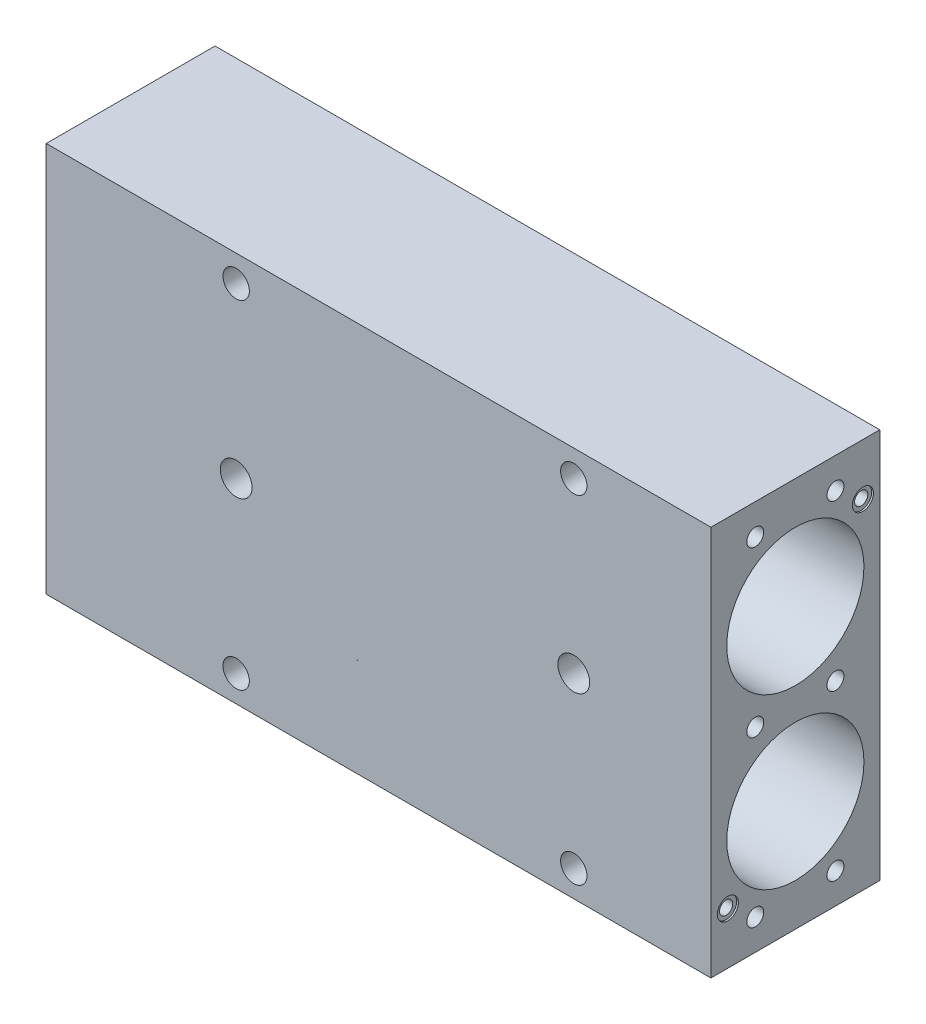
ISO-10303-21;
HEADER;
FILE_DESCRIPTION(('STEP AP214'),'2;1');
FILE_NAME('part.step','',(''),(''),'','','');
FILE_SCHEMA(('AUTOMOTIVE_DESIGN { 1 0 10303 214 1 1 1 1 }'));
ENDSEC;
DATA;
#1=APPLICATION_CONTEXT('core data for automotive mechanical design processes');
#2=APPLICATION_PROTOCOL_DEFINITION('international standard','automotive_design',2000,#1);
#3=PRODUCT_CONTEXT('',#1,'mechanical');
#4=PRODUCT('Part','Part','',(#3));
#5=PRODUCT_RELATED_PRODUCT_CATEGORY('part','',(#4));
#6=PRODUCT_DEFINITION_FORMATION('','',#4);
#7=PRODUCT_DEFINITION_CONTEXT('part definition',#1,'design');
#8=PRODUCT_DEFINITION('design','',#6,#7);
#9=PRODUCT_DEFINITION_SHAPE('','',#8);
#10=(LENGTH_UNIT() NAMED_UNIT(*) SI_UNIT(.MILLI.,.METRE.));
#11=(NAMED_UNIT(*) PLANE_ANGLE_UNIT() SI_UNIT($,.RADIAN.));
#12=(NAMED_UNIT(*) SI_UNIT($,.STERADIAN.) SOLID_ANGLE_UNIT());
#13=UNCERTAINTY_MEASURE_WITH_UNIT(LENGTH_MEASURE(1.E-05),#10,'distance_accuracy_value','');
#14=(GEOMETRIC_REPRESENTATION_CONTEXT(3) GLOBAL_UNCERTAINTY_ASSIGNED_CONTEXT((#13)) GLOBAL_UNIT_ASSIGNED_CONTEXT((#10,
#11,#12)) REPRESENTATION_CONTEXT('',''));
#15=CARTESIAN_POINT('',(0.,0.,0.));
#16=DIRECTION('',(0.,0.,1.));
#17=DIRECTION('',(1.,0.,0.));
#18=AXIS2_PLACEMENT_3D('',#15,#16,#17);
#19=CARTESIAN_POINT('',(-107.95,-58.7375,25.4));
#20=DIRECTION('',(0.,0.,1.));
#21=DIRECTION('',(1.,0.,0.));
#22=AXIS2_PLACEMENT_3D('',#19,#20,#21);
#23=PLANE('',#22);
#24=DIRECTION('',(0.,-1.,0.));
#25=VECTOR('',#24,1.);
#26=CARTESIAN_POINT('',(-107.95,58.7375,25.4));
#27=LINE('',#26,#25);
#28=CARTESIAN_POINT('',(-107.95,58.7375,25.4));
#29=VERTEX_POINT('',#28);
#30=CARTESIAN_POINT('',(-107.95,-58.7375,25.4));
#31=VERTEX_POINT('',#30);
#32=EDGE_CURVE('E338',#29,#31,#27,.T.);
#33=ORIENTED_EDGE('',*,*,#32,.T.);
#34=DIRECTION('',(1.,0.,0.));
#35=VECTOR('',#34,1.);
#36=CARTESIAN_POINT('',(-107.95,-58.7375,25.4));
#37=LINE('',#36,#35);
#38=CARTESIAN_POINT('',(92.075,-58.7375,25.4));
#39=VERTEX_POINT('',#38);
#40=EDGE_CURVE('E341',#31,#39,#37,.T.);
#41=ORIENTED_EDGE('',*,*,#40,.T.);
#42=DIRECTION('',(0.,1.,0.));
#43=VECTOR('',#42,1.);
#44=CARTESIAN_POINT('',(92.075,58.7375,25.4));
#45=LINE('',#44,#43);
#46=CARTESIAN_POINT('',(92.075,58.7375,25.4));
#47=VERTEX_POINT('',#46);
#48=EDGE_CURVE('E344',#39,#47,#45,.T.);
#49=ORIENTED_EDGE('',*,*,#48,.T.);
#50=DIRECTION('',(-1.,0.,0.));
#51=VECTOR('',#50,1.);
#52=CARTESIAN_POINT('',(-107.95,58.7375,25.4));
#53=LINE('',#52,#51);
#54=EDGE_CURVE('E346',#47,#29,#53,.T.);
#55=ORIENTED_EDGE('',*,*,#54,.T.);
#56=EDGE_LOOP('',(#33,#41,#49,#55));
#57=FACE_BOUND('',#56,.T.);
#58=CARTESIAN_POINT('',(50.8,50.8,25.4));
#59=DIRECTION('',(0.,0.,1.));
#60=DIRECTION('',(1.,0.,0.));
#61=AXIS2_PLACEMENT_3D('',#58,#59,#60);
#62=CIRCLE('',#61,3.96874999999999);
#63=CARTESIAN_POINT('',(54.76875,50.8,25.4));
#64=VERTEX_POINT('',#63);
#65=EDGE_CURVE('E283',#64,#64,#62,.T.);
#66=ORIENTED_EDGE('',*,*,#65,.F.);
#67=EDGE_LOOP('',(#66));
#68=FACE_BOUND('',#67,.T.);
#69=CARTESIAN_POINT('',(50.8,-50.8,25.4));
#70=DIRECTION('',(0.,0.,1.));
#71=DIRECTION('',(1.,0.,0.));
#72=AXIS2_PLACEMENT_3D('',#69,#70,#71);
#73=CIRCLE('',#72,3.96874999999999);
#74=CARTESIAN_POINT('',(54.76875,-50.8,25.4));
#75=VERTEX_POINT('',#74);
#76=EDGE_CURVE('E277',#75,#75,#73,.T.);
#77=ORIENTED_EDGE('',*,*,#76,.F.);
#78=EDGE_LOOP('',(#77));
#79=FACE_BOUND('',#78,.T.);
#80=CARTESIAN_POINT('',(-50.8,-50.8,25.4));
#81=DIRECTION('',(0.,0.,1.));
#82=DIRECTION('',(1.,0.,0.));
#83=AXIS2_PLACEMENT_3D('',#80,#81,#82);
#84=CIRCLE('',#83,3.96874999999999);
#85=CARTESIAN_POINT('',(-46.83125,-50.8,25.4));
#86=VERTEX_POINT('',#85);
#87=EDGE_CURVE('E271',#86,#86,#84,.T.);
#88=ORIENTED_EDGE('',*,*,#87,.F.);
#89=EDGE_LOOP('',(#88));
#90=FACE_BOUND('',#89,.T.);
#91=CARTESIAN_POINT('',(-50.8,50.8,25.4));
#92=DIRECTION('',(0.,0.,1.));
#93=DIRECTION('',(1.,0.,0.));
#94=AXIS2_PLACEMENT_3D('',#91,#92,#93);
#95=CIRCLE('',#94,3.96874999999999);
#96=CARTESIAN_POINT('',(-46.83125,50.8,25.4));
#97=VERTEX_POINT('',#96);
#98=EDGE_CURVE('E265',#97,#97,#95,.T.);
#99=ORIENTED_EDGE('',*,*,#98,.F.);
#100=EDGE_LOOP('',(#99));
#101=FACE_BOUND('',#100,.T.);
#102=CARTESIAN_POINT('',(-50.8,0.,25.4));
#103=DIRECTION('',(0.,0.,1.));
#104=DIRECTION('',(1.,0.,0.));
#105=AXIS2_PLACEMENT_3D('',#102,#103,#104);
#106=CIRCLE('',#105,4.7879);
#107=CARTESIAN_POINT('',(-46.0121,0.,25.4));
#108=VERTEX_POINT('',#107);
#109=EDGE_CURVE('E256',#108,#108,#106,.T.);
#110=ORIENTED_EDGE('',*,*,#109,.F.);
#111=EDGE_LOOP('',(#110));
#112=FACE_BOUND('',#111,.T.);
#113=CARTESIAN_POINT('',(50.8,0.,25.4));
#114=DIRECTION('',(0.,0.,-1.));
#115=DIRECTION('',(-1.,0.,0.));
#116=AXIS2_PLACEMENT_3D('',#113,#114,#115);
#117=CIRCLE('',#116,4.7879);
#118=CARTESIAN_POINT('',(46.0121,0.,25.4));
#119=VERTEX_POINT('',#118);
#120=EDGE_CURVE('E615',#119,#119,#117,.T.);
#121=ORIENTED_EDGE('',*,*,#120,.T.);
#122=EDGE_LOOP('',(#121));
#123=FACE_BOUND('',#122,.T.);
#124=ADVANCED_FACE('F36',(#57,#68,#79,#90,#101,#112,#123),#23,.T.);
#125=CARTESIAN_POINT('',(92.075,-25.3999999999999,0.));
#126=DIRECTION('',(-1.,0.,0.));
#127=DIRECTION('',(0.,-1.,0.));
#128=AXIS2_PLACEMENT_3D('',#125,#126,#127);
#129=CYLINDRICAL_SURFACE('',#128,20.6375);
#130=DIRECTION('',(-1.,0.,0.));
#131=VECTOR('',#130,1.);
#132=CARTESIAN_POINT('',(92.075,-17.4624999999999,19.05));
#133=LINE('',#132,#131);
#134=CARTESIAN_POINT('',(-12.696030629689,-17.4625,19.05));
#135=VERTEX_POINT('',#134);
#136=CARTESIAN_POINT('',(12.696030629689,-17.4625,19.05));
#137=VERTEX_POINT('',#136);
#138=EDGE_CURVE('E11',#135,#137,#133,.F.);
#139=ORIENTED_EDGE('',*,*,#138,.T.);
#140=CARTESIAN_POINT('',(0.,-21.59,20.2827588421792));
#141=CARTESIAN_POINT('',(-0.581682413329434,-21.5900001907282,20.2827580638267));
#142=CARTESIAN_POINT('',(-1.16335642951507,-21.5664781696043,20.2783825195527));
#143=CARTESIAN_POINT('',(-2.32296551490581,-21.4725501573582,20.2604006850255));
#144=CARTESIAN_POINT('',(-2.90089928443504,-21.4021286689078,20.2467913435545));
#145=CARTESIAN_POINT('',(-4.04981337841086,-21.2147693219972,20.2088938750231));
#146=CARTESIAN_POINT('',(-4.62078063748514,-21.0977548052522,20.1845881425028));
#147=CARTESIAN_POINT('',(-5.75070157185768,-20.8181700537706,20.1229649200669));
#148=CARTESIAN_POINT('',(-6.30965623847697,-20.6556035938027,20.0856485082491));
#149=CARTESIAN_POINT('',(-7.41271857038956,-20.285925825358,19.994723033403));
#150=CARTESIAN_POINT('',(-7.95678981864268,-20.0787146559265,19.9410773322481));
#151=CARTESIAN_POINT('',(-9.02450433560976,-19.6220164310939,19.8135683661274));
#152=CARTESIAN_POINT('',(-9.54814686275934,-19.3725278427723,19.7397043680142));
#153=CARTESIAN_POINT('',(-10.5701377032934,-18.834369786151,19.5672848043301));
#154=CARTESIAN_POINT('',(-11.0685067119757,-18.5457331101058,19.4687498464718));
#155=CARTESIAN_POINT('',(-12.0358887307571,-17.9330183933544,19.2420686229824));
#156=CARTESIAN_POINT('',(-12.5049046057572,-17.6089438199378,19.1139252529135));
#157=CARTESIAN_POINT('',(-13.3827273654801,-16.9503385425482,18.8316303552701));
#158=CARTESIAN_POINT('',(-13.7934510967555,-16.6175259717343,18.6794366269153));
#159=CARTESIAN_POINT('',(-14.5815294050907,-15.9304829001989,18.3406990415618));
#160=CARTESIAN_POINT('',(-14.9588853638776,-15.5762532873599,18.1541566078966));
#161=CARTESIAN_POINT('',(-15.6769463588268,-14.8533082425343,17.7439054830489));
#162=CARTESIAN_POINT('',(-16.0176898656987,-14.4846085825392,17.5202364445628));
#163=CARTESIAN_POINT('',(-16.6609329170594,-13.7398491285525,17.0336419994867));
#164=CARTESIAN_POINT('',(-16.963437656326,-13.3637903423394,16.7707219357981));
#165=CARTESIAN_POINT('',(-17.4924102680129,-12.6614023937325,16.2419769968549));
#166=CARTESIAN_POINT('',(-17.7236490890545,-12.3349900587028,15.9810119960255));
#167=CARTESIAN_POINT('',(-18.1568685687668,-11.6879334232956,15.4293970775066));
#168=CARTESIAN_POINT('',(-18.3588520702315,-11.367288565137,15.1387500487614));
#169=CARTESIAN_POINT('',(-18.7345985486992,-10.7367454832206,14.528861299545));
#170=CARTESIAN_POINT('',(-18.9083563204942,-10.4268492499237,14.209614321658));
#171=CARTESIAN_POINT('',(-19.2292649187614,-9.82245311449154,13.5443133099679));
#172=CARTESIAN_POINT('',(-19.3764150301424,-9.52795362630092,13.1982585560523));
#173=CARTESIAN_POINT('',(-19.6428148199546,-8.96561724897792,12.4906572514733));
#174=CARTESIAN_POINT('',(-19.7626783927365,-8.69729303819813,12.129727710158));
#175=CARTESIAN_POINT('',(-19.9814332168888,-8.1822209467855,11.3867825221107));
#176=CARTESIAN_POINT('',(-20.0803250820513,-7.93547243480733,11.0047674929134));
#177=CARTESIAN_POINT('',(-20.2595493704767,-7.46605116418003,10.2219490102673));
#178=CARTESIAN_POINT('',(-20.339877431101,-7.24338407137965,9.82114116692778));
#179=CARTESIAN_POINT('',(-20.4843140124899,-6.82423097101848,9.00324515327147));
#180=CARTESIAN_POINT('',(-20.5484215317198,-6.62774658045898,8.58615597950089));
#181=CARTESIAN_POINT('',(-20.6681250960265,-6.24505537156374,7.69743172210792));
#182=CARTESIAN_POINT('',(-20.7223147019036,-6.06164259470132,7.22440231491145));
#183=CARTESIAN_POINT('',(-20.8165071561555,-5.7298237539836,6.26484997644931));
#184=CARTESIAN_POINT('',(-20.8565092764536,-5.58141948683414,5.77832635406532));
#185=CARTESIAN_POINT('',(-20.9245272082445,-5.32075416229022,4.79470904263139));
#186=CARTESIAN_POINT('',(-20.9525391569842,-5.20850475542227,4.29761200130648));
#187=CARTESIAN_POINT('',(-20.9982529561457,-5.02103292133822,3.29601768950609));
#188=CARTESIAN_POINT('',(-21.0159544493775,-4.94581177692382,2.79152016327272));
#189=CARTESIAN_POINT('',(-21.0433170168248,-4.82813923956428,1.73515498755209));
#190=CARTESIAN_POINT('',(-21.0521701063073,-4.78900296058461,1.18289429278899));
#191=CARTESIAN_POINT('',(-21.0598240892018,-4.75522801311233,0.0769259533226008));
#192=CARTESIAN_POINT('',(-21.0586244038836,-4.7605919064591,-0.476781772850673));
#193=CARTESIAN_POINT('',(-21.0460707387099,-4.81578773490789,-1.58204059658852));
#194=CARTESIAN_POINT('',(-21.0347135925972,-4.86563353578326,-2.13359096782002));
#195=CARTESIAN_POINT('',(-21.0009348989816,-5.00941866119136,-3.230574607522));
#196=CARTESIAN_POINT('',(-20.9785133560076,-5.10335796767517,-3.77600787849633));
#197=CARTESIAN_POINT('',(-20.9203115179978,-5.33699072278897,-4.86831423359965));
#198=CARTESIAN_POINT('',(-20.884260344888,-5.47760436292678,-5.41497661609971));
#199=CARTESIAN_POINT('',(-20.7962753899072,-5.80270329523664,-6.49382442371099));
#200=CARTESIAN_POINT('',(-20.744341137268,-5.98718988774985,-7.02600941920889));
#201=CARTESIAN_POINT('',(-20.621300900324,-6.39812637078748,-8.07159628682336));
#202=CARTESIAN_POINT('',(-20.5501970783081,-6.62457152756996,-8.58500026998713));
#203=CARTESIAN_POINT('',(-20.3849553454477,-7.11681472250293,-9.58873825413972));
#204=CARTESIAN_POINT('',(-20.2908187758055,-7.3826104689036,-10.0790735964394));
#205=CARTESIAN_POINT('',(-20.079478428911,-7.93899674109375,-11.0138098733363));
#206=CARTESIAN_POINT('',(-19.9633113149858,-8.22822518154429,-11.4592548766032));
#207=CARTESIAN_POINT('',(-19.701992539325,-8.83565685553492,-12.3209883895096));
#208=CARTESIAN_POINT('',(-19.5568415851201,-9.1538593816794,-12.7372776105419));
#209=CARTESIAN_POINT('',(-19.2341896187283,-9.81369972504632,-13.536689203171));
#210=CARTESIAN_POINT('',(-19.056724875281,-10.1553110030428,-13.9198480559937));
#211=CARTESIAN_POINT('',(-18.6664143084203,-10.8560471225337,-14.6504589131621));
#212=CARTESIAN_POINT('',(-18.4535729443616,-11.2151697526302,-14.997915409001));
#213=CARTESIAN_POINT('',(-18.0151122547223,-11.9051565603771,-15.6201178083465));
#214=CARTESIAN_POINT('',(-17.7932391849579,-12.2349807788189,-15.8986670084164));
#215=CARTESIAN_POINT('',(-17.3190513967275,-12.8974574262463,-16.4247284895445));
#216=CARTESIAN_POINT('',(-17.0667390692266,-13.2301096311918,-16.6722432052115));
#217=CARTESIAN_POINT('',(-16.5318736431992,-13.8926782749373,-17.1362653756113));
#218=CARTESIAN_POINT('',(-16.2493211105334,-14.2225947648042,-17.35277341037));
#219=CARTESIAN_POINT('',(-15.6549346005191,-14.8743271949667,-17.7556590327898));
#220=CARTESIAN_POINT('',(-15.3431005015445,-15.1961431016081,-17.9420364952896));
#221=CARTESIAN_POINT('',(-14.7076080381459,-15.8114010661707,-18.2779112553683));
#222=CARTESIAN_POINT('',(-14.3852592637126,-16.1054620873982,-18.428759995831));
#223=CARTESIAN_POINT('',(-13.7173336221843,-16.678019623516,-18.7065425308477));
#224=CARTESIAN_POINT('',(-13.3717577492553,-16.9565168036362,-18.8334773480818));
#225=CARTESIAN_POINT('',(-12.6593119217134,-17.4948374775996,-19.0656968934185));
#226=CARTESIAN_POINT('',(-12.2924360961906,-17.7546557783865,-19.1709756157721));
#227=CARTESIAN_POINT('',(-11.539638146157,-18.2529078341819,-19.3622496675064));
#228=CARTESIAN_POINT('',(-11.153714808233,-18.4913402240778,-19.4482437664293));
#229=CARTESIAN_POINT('',(-10.32913675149,-18.9653173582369,-19.6104469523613));
#230=CARTESIAN_POINT('',(-9.88887961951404,-19.1986240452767,-19.6850530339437));
#231=CARTESIAN_POINT('',(-8.99120562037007,-19.635056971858,-19.8172612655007));
#232=CARTESIAN_POINT('',(-8.5337879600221,-19.8381818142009,-19.8748626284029));
#233=CARTESIAN_POINT('',(-7.60441791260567,-20.2126697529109,-19.9758767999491));
#234=CARTESIAN_POINT('',(-7.13245999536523,-20.3840205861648,-20.0192841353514));
#235=CARTESIAN_POINT('',(-6.17689972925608,-20.693629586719,-20.0943237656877));
#236=CARTESIAN_POINT('',(-5.693296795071,-20.8318860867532,-20.1259554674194));
#237=CARTESIAN_POINT('',(-4.65761566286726,-21.0891677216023,-20.1827307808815));
#238=CARTESIAN_POINT('',(-4.10437209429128,-21.2037988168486,-20.2066147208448));
#239=CARTESIAN_POINT('',(-2.99025099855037,-21.389378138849,-20.2442651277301));
#240=CARTESIAN_POINT('',(-2.42937291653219,-21.4603231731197,-20.2580308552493));
#241=CARTESIAN_POINT('',(-1.30346969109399,-21.5580250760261,-20.2767877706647));
#242=CARTESIAN_POINT('',(-0.738443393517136,-21.5847691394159,-20.2817764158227));
#243=CARTESIAN_POINT('',(0.39197656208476,-21.5938408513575,-20.2834801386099));
#244=CARTESIAN_POINT('',(0.957370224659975,-21.576167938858,-20.2801951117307));
#245=CARTESIAN_POINT('',(2.11378323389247,-21.4944862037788,-20.2646300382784));
#246=CARTESIAN_POINT('',(2.70463396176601,-21.4281533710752,-20.2518984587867));
#247=CARTESIAN_POINT('',(3.87855851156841,-21.2470616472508,-20.2155389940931));
#248=CARTESIAN_POINT('',(4.46163196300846,-21.1323004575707,-20.1919105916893));
#249=CARTESIAN_POINT('',(5.61591722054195,-20.85526201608,-20.1313651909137));
#250=CARTESIAN_POINT('',(6.18712470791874,-20.6929677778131,-20.0944434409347));
#251=CARTESIAN_POINT('',(7.3130763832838,-20.3223582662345,-20.0040076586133));
#252=CARTESIAN_POINT('',(7.86782098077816,-20.1140441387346,-19.9504940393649));
#253=CARTESIAN_POINT('',(8.9505399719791,-19.6559844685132,-19.8234341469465));
#254=CARTESIAN_POINT('',(9.47873692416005,-19.4067049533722,-19.7501078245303));
#255=CARTESIAN_POINT('',(10.5101314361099,-18.8680588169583,-19.5785596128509));
#256=CARTESIAN_POINT('',(11.0133286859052,-18.578691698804,-19.4803374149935));
#257=CARTESIAN_POINT('',(11.9896067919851,-17.9641237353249,-19.2541215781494));
#258=CARTESIAN_POINT('',(12.4627184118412,-17.6389604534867,-19.1261589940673));
#259=CARTESIAN_POINT('',(13.3748128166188,-16.9577789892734,-18.8354001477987));
#260=CARTESIAN_POINT('',(13.8138007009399,-16.6017654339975,-18.6726091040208));
#261=CARTESIAN_POINT('',(14.6131854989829,-15.9008759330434,-18.3251456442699));
#262=CARTESIAN_POINT('',(14.9770819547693,-15.5582065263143,-18.144069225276));
#263=CARTESIAN_POINT('',(15.6709862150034,-14.8590306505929,-17.7469965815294));
#264=CARTESIAN_POINT('',(16.0009964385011,-14.5025251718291,-17.5310028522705));
#265=CARTESIAN_POINT('',(16.6250595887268,-13.7826806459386,-17.0624888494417));
#266=CARTESIAN_POINT('',(16.9191394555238,-13.4193469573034,-16.8099962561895));
#267=CARTESIAN_POINT('',(17.4707952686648,-12.6928109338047,-16.2677315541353));
#268=CARTESIAN_POINT('',(17.7283744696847,-12.3296085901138,-15.9779627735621));
#269=CARTESIAN_POINT('',(18.1785042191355,-11.6539509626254,-15.3988976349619));
#270=CARTESIAN_POINT('',(18.3751504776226,-11.34065285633,-15.113748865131));
#271=CARTESIAN_POINT('',(18.741443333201,-10.7244975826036,-14.5162029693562));
#272=CARTESIAN_POINT('',(18.9110924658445,-10.4216394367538,-14.2038084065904));
#273=CARTESIAN_POINT('',(19.2249849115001,-9.83057037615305,-13.553319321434));
#274=CARTESIAN_POINT('',(19.3692216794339,-9.54236324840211,-13.2152182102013));
#275=CARTESIAN_POINT('',(19.6342465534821,-8.98442454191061,-12.5154133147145));
#276=CARTESIAN_POINT('',(19.7550335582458,-8.71469383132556,-12.1537084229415));
#277=CARTESIAN_POINT('',(19.9769385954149,-8.19337537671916,-11.4039376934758));
#278=CARTESIAN_POINT('',(20.0777669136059,-7.94208412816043,-11.0155803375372));
#279=CARTESIAN_POINT('',(20.2601881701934,-7.46446576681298,-10.2195159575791));
#280=CARTESIAN_POINT('',(20.3417811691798,-7.23813857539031,-9.81180899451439));
#281=CARTESIAN_POINT('',(20.4882417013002,-6.81254227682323,-8.97949663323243));
#282=CARTESIAN_POINT('',(20.5531048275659,-6.6132803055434,-8.55488681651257));
#283=CARTESIAN_POINT('',(20.6684196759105,-6.24355902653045,-7.6914107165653));
#284=CARTESIAN_POINT('',(20.7188705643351,-6.07310138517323,-7.25254361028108));
#285=CARTESIAN_POINT('',(20.8121067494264,-5.7459773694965,-6.31638555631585));
#286=CARTESIAN_POINT('',(20.8535326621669,-5.59263369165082,-5.81779543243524));
#287=CARTESIAN_POINT('',(20.9237322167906,-5.32398388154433,-4.80959517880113));
#288=CARTESIAN_POINT('',(20.9525051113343,-5.20867999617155,-4.29998439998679));
#289=CARTESIAN_POINT('',(20.9992345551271,-5.01697103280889,-3.27285064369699));
#290=CARTESIAN_POINT('',(21.0171877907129,-4.94057787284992,-2.75532529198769));
#291=CARTESIAN_POINT('',(21.0434948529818,-4.82729679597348,-1.71572780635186));
#292=CARTESIAN_POINT('',(21.0518484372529,-4.79040987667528,-1.19365555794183));
#293=CARTESIAN_POINT('',(21.0598257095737,-4.75523360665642,-0.112096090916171));
#294=CARTESIAN_POINT('',(21.0588081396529,-4.75977923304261,0.447490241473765));
#295=CARTESIAN_POINT('',(21.0464144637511,-4.81428100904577,1.56435370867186));
#296=CARTESIAN_POINT('',(21.035037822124,-4.864239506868,2.12163072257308));
#297=CARTESIAN_POINT('',(21.0009918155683,-5.009190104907,3.23014106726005));
#298=CARTESIAN_POINT('',(20.9783188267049,-5.104196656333,3.78137240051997));
#299=CARTESIAN_POINT('',(20.9199336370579,-5.33844862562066,4.87365764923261));
#300=CARTESIAN_POINT('',(20.8842215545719,-5.47769364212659,5.41471165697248));
#301=CARTESIAN_POINT('',(20.7969292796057,-5.80034104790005,6.48654454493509));
#302=CARTESIAN_POINT('',(20.7452350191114,-5.98405873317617,7.01721942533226));
#303=CARTESIAN_POINT('',(20.6228037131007,-6.39324999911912,8.05999585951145));
#304=CARTESIAN_POINT('',(20.5520662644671,-6.61872446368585,8.5720970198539));
#305=CARTESIAN_POINT('',(20.387761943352,-7.10872491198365,9.57319480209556));
#306=CARTESIAN_POINT('',(20.2942054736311,-7.37323307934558,10.0622018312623));
#307=CARTESIAN_POINT('',(20.0800741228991,-7.93787227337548,11.0129964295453));
#308=CARTESIAN_POINT('',(19.9595015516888,-8.23800025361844,11.4747863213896));
#309=CARTESIAN_POINT('',(19.6950211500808,-8.85093291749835,12.3409773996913));
#310=CARTESIAN_POINT('',(19.552876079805,-9.16198800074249,12.7471540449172));
#311=CARTESIAN_POINT('',(19.2375576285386,-9.80679300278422,13.5282930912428));
#312=CARTESIAN_POINT('',(19.0643856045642,-10.1405419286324,13.9032568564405));
#313=CARTESIAN_POINT('',(18.6844520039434,-10.8246115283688,14.6187970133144));
#314=CARTESIAN_POINT('',(18.4777227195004,-11.174916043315,14.9594059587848));
#315=CARTESIAN_POINT('',(18.0286799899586,-11.8857639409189,15.6045556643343));
#316=CARTESIAN_POINT('',(17.7863702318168,-12.2463062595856,15.9091001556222));
#317=CARTESIAN_POINT('',(17.2934726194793,-12.9314482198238,16.4502662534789));
#318=CARTESIAN_POINT('',(17.0465884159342,-13.2557358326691,16.6906707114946));
#319=CARTESIAN_POINT('',(16.5240941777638,-13.9016143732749,17.1420166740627));
#320=CARTESIAN_POINT('',(16.2484864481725,-14.2232055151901,17.3529605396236));
#321=CARTESIAN_POINT('',(15.6694094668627,-14.8587531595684,17.7462175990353));
#322=CARTESIAN_POINT('',(15.3659372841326,-15.172708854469,17.9285277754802));
#323=CARTESIAN_POINT('',(14.7326319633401,-15.7883720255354,18.2659871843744));
#324=CARTESIAN_POINT('',(14.4027980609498,-16.090079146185,18.4211356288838));
#325=CARTESIAN_POINT('',(13.7231674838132,-16.6733531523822,18.7044332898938));
#326=CARTESIAN_POINT('',(13.3736873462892,-16.9551314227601,18.8329083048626));
#327=CARTESIAN_POINT('',(12.6530508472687,-17.4994952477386,19.0676773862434));
#328=CARTESIAN_POINT('',(12.2818948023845,-17.7620810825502,19.1739717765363));
#329=CARTESIAN_POINT('',(11.5199225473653,-18.265490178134,19.3669282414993));
#330=CARTESIAN_POINT('',(11.1290946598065,-18.5063002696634,19.453578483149));
#331=CARTESIAN_POINT('',(10.3302762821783,-18.9637917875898,19.6096930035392));
#332=CARTESIAN_POINT('',(9.92228497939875,-19.1804720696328,19.6791564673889));
#333=CARTESIAN_POINT('',(9.04430723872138,-19.6110672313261,19.8103749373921));
#334=CARTESIAN_POINT('',(8.57253559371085,-19.8218847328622,19.8703637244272));
#335=CARTESIAN_POINT('',(7.61359430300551,-20.209622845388,19.9751529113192));
#336=CARTESIAN_POINT('',(7.12642263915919,-20.3865389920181,20.0199513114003));
#337=CARTESIAN_POINT('',(6.14013432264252,-20.7049548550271,20.0970093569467));
#338=CARTESIAN_POINT('',(5.64102802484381,-20.8464841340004,20.1292794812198));
#339=CARTESIAN_POINT('',(4.63354151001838,-21.0933015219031,20.1835252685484));
#340=CARTESIAN_POINT('',(4.12516354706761,-21.1985983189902,20.2055033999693));
#341=CARTESIAN_POINT('',(3.0171850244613,-21.3866878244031,20.24377787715));
#342=CARTESIAN_POINT('',(2.41640013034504,-21.4628806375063,20.2585338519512));
#343=CARTESIAN_POINT('',(1.21040717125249,-21.5645370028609,20.2780248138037));
#344=CARTESIAN_POINT('',(0.605199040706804,-21.5899998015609,20.2827596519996));
#345=CARTESIAN_POINT('',(0.,-21.59,20.2827588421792));
#346=B_SPLINE_CURVE_WITH_KNOTS('',3,(#140,#141,#142,#143,#144,#145,#146,#147,#148,#149,#150,
#151,#152,#153,#154,#155,#156,#157,#158,#159,#160,#161,#162,#163,#164,#165,#166,#167,#168,#169,
#170,#171,#172,#173,#174,#175,#176,#177,#178,#179,#180,#181,#182,#183,#184,#185,#186,#187,#188,
#189,#190,#191,#192,#193,#194,#195,#196,#197,#198,#199,#200,#201,#202,#203,#204,#205,#206,#207,
#208,#209,#210,#211,#212,#213,#214,#215,#216,#217,#218,#219,#220,#221,#222,#223,#224,#225,#226,
#227,#228,#229,#230,#231,#232,#233,#234,#235,#236,#237,#238,#239,#240,#241,#242,#243,#244,#245,
#246,#247,#248,#249,#250,#251,#252,#253,#254,#255,#256,#257,#258,#259,#260,#261,#262,#263,#264,
#265,#266,#267,#268,#269,#270,#271,#272,#273,#274,#275,#276,#277,#278,#279,#280,#281,#282,#283,
#284,#285,#286,#287,#288,#289,#290,#291,#292,#293,#294,#295,#296,#297,#298,#299,#300,#301,#302,
#303,#304,#305,#306,#307,#308,#309,#310,#311,#312,#313,#314,#315,#316,#317,#318,#319,#320,#321,
#322,#323,#324,#325,#326,#327,#328,#329,#330,#331,#332,#333,#334,#335,#336,#337,#338,#339,#340,
#341,#342,#343,#344,#345),.UNSPECIFIED.,.T.,.F.,(4,2,2,2,2,2,2,2,2,2,2,2,2,2,2,2,2,2,2,2,2,2,2,
2,2,2,2,2,2,2,2,2,2,2,2,2,2,2,2,2,2,2,2,2,2,2,2,2,2,2,2,2,2,2,2,2,2,2,2,2,2,2,2,2,2,2,2,2,2,2,2,
2,2,2,2,2,2,2,2,2,2,2,2,2,2,2,2,2,2,2,2,2,2,2,2,2,2,2,2,2,2,2,4),(0.,1.74454060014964,
3.48965794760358,5.23765843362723,6.98551411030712,8.73732073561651,10.4891908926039,
12.2396025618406,13.9898431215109,15.637789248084,17.2856671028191,18.9317961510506,
20.57770132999,22.0087422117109,23.4396439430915,24.8708092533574,26.3020130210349,
27.6968530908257,29.0916523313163,30.4867790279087,31.8819918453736,33.411046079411,
34.9401787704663,36.4698037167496,37.9994816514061,39.658719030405,41.318051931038,
42.9779022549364,44.637751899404,46.3324894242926,48.0272771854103,49.7218738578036,
51.4163718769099,53.0451267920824,54.6738419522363,56.300740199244,57.927433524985,
59.3816887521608,60.835829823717,62.289943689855,63.7440635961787,65.1275688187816,
66.5110148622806,67.8948440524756,69.2787615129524,70.7886400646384,72.298588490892,
73.8091184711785,75.3197245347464,77.0143392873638,78.7090778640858,80.4043073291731,
82.0995582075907,83.8815275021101,85.663581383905,87.4462728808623,89.2289199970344,
90.9925370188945,92.7561759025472,94.5179814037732,96.2795231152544,97.8721192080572,
99.4646015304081,101.055882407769,102.647021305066,104.046496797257,105.445840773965,
106.845544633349,108.245314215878,109.664113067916,111.082907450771,112.502075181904,
113.921324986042,115.489461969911,117.057691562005,118.626401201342,120.195150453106,
121.872004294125,123.548944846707,125.22642371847,126.903887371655,128.593611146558,
130.283370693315,131.972361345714,133.661207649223,135.251933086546,136.842588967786,
138.431723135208,140.020692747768,141.438491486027,142.856176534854,144.274010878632,
145.691886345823,147.091265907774,148.490625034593,149.890824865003,151.291091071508,
152.850076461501,154.409267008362,155.967150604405,157.524660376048,159.339703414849,
161.154773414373),.UNSPECIFIED.);
#347=EDGE_CURVE('E51',#135,#137,#346,.T.);
#348=ORIENTED_EDGE('',*,*,#347,.F.);
#349=EDGE_LOOP('',(#139,#348));
#350=FACE_BOUND('',#349,.T.);
#351=CARTESIAN_POINT('',(92.075,-25.3999999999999,0.));
#352=DIRECTION('',(-1.,0.,0.));
#353=DIRECTION('',(0.,1.,0.));
#354=AXIS2_PLACEMENT_3D('',#351,#352,#353);
#355=CIRCLE('',#354,20.6375);
#356=CARTESIAN_POINT('',(92.075,-4.76249999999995,0.));
#357=VERTEX_POINT('',#356);
#358=EDGE_CURVE('E286',#357,#357,#355,.T.);
#359=ORIENTED_EDGE('',*,*,#358,.F.);
#360=EDGE_LOOP('',(#359));
#361=FACE_BOUND('',#360,.T.);
#362=CARTESIAN_POINT('',(-92.71,-25.4,0.));
#363=DIRECTION('',(-1.,0.,0.));
#364=DIRECTION('',(0.,-1.,0.));
#365=AXIS2_PLACEMENT_3D('',#362,#363,#364);
#366=CIRCLE('',#365,20.6375);
#367=CARTESIAN_POINT('',(-92.71,-46.0375,0.));
#368=VERTEX_POINT('',#367);
#369=EDGE_CURVE('E40',#368,#368,#366,.F.);
#370=ORIENTED_EDGE('',*,*,#369,.F.);
#371=EDGE_LOOP('',(#370));
#372=FACE_BOUND('',#371,.T.);
#373=ADVANCED_FACE('F300',(#350,#361,#372),#129,.F.);
#374=CARTESIAN_POINT('',(92.075,25.4,0.));
#375=DIRECTION('',(-1.,0.,0.));
#376=DIRECTION('',(0.,-1.,0.));
#377=AXIS2_PLACEMENT_3D('',#374,#375,#376);
#378=CYLINDRICAL_SURFACE('',#377,20.6375);
#379=DIRECTION('',(-1.,0.,0.));
#380=VECTOR('',#379,1.);
#381=CARTESIAN_POINT('',(92.075,17.4625,19.05));
#382=LINE('',#381,#380);
#383=CARTESIAN_POINT('',(12.6960306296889,17.4625,19.05));
#384=VERTEX_POINT('',#383);
#385=CARTESIAN_POINT('',(-12.6960306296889,17.4625,19.05));
#386=VERTEX_POINT('',#385);
#387=EDGE_CURVE('E45',#384,#386,#382,.T.);
#388=ORIENTED_EDGE('',*,*,#387,.T.);
#389=CARTESIAN_POINT('',(12.6960306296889,17.4625,19.05));
#390=CARTESIAN_POINT('',(12.8832229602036,17.3264107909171,18.993295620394));
#391=CARTESIAN_POINT('',(13.0676677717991,17.1877022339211,18.9337893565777));
#392=CARTESIAN_POINT('',(13.4307928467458,16.9054640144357,18.8088566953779));
#393=CARTESIAN_POINT('',(13.6094727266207,16.7619340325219,18.7434299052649));
#394=CARTESIAN_POINT('',(13.9608401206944,16.4704334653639,18.6063212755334));
#395=CARTESIAN_POINT('',(14.1335253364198,16.3224612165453,18.5346370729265));
#396=CARTESIAN_POINT('',(14.4725507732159,16.0226282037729,18.3847602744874));
#397=CARTESIAN_POINT('',(14.6388911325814,15.8707675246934,18.30656782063));
#398=CARTESIAN_POINT('',(15.1275806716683,15.4105236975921,18.0620394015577));
#399=CARTESIAN_POINT('',(15.4401580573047,15.0970125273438,17.8855363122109));
#400=CARTESIAN_POINT('',(16.0373004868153,14.461099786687,17.5038382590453));
#401=CARTESIAN_POINT('',(16.3218708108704,14.1386999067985,17.2986487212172));
#402=CARTESIAN_POINT('',(16.8630025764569,13.4887607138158,16.8577422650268));
#403=CARTESIAN_POINT('',(17.1194609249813,13.1612072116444,16.6219194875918));
#404=CARTESIAN_POINT('',(17.6028087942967,12.5073803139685,16.1200678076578));
#405=CARTESIAN_POINT('',(17.8296962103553,12.1811070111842,15.8540367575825));
#406=CARTESIAN_POINT('',(18.2540217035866,11.5355053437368,15.292644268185));
#407=CARTESIAN_POINT('',(18.4514919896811,11.2161697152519,14.9973155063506));
#408=CARTESIAN_POINT('',(18.8183847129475,10.5890748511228,14.3783509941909));
#409=CARTESIAN_POINT('',(18.9878079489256,10.2813152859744,14.0547160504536));
#410=CARTESIAN_POINT('',(19.2950063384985,9.69213359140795,13.3924988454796));
#411=CARTESIAN_POINT('',(19.4336652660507,9.41017080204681,13.0548055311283));
#412=CARTESIAN_POINT('',(19.688431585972,8.86478303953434,12.3567469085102));
#413=CARTESIAN_POINT('',(19.8045394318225,8.60135769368,11.9963820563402));
#414=CARTESIAN_POINT('',(20.0165327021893,8.09578620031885,11.2548723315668));
#415=CARTESIAN_POINT('',(20.1123996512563,7.85365961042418,10.8737088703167));
#416=CARTESIAN_POINT('',(20.2861162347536,7.39338319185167,10.0932379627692));
#417=CARTESIAN_POINT('',(20.3639648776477,7.17523468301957,9.69392951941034));
#418=CARTESIAN_POINT('',(20.5095403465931,6.74846014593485,8.84697303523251));
#419=CARTESIAN_POINT('',(20.5759599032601,6.54199067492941,8.39801291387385));
#420=CARTESIAN_POINT('',(20.6931673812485,6.16121888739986,7.48468784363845));
#421=CARTESIAN_POINT('',(20.7439546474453,5.9869179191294,7.02032225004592));
#422=CARTESIAN_POINT('',(20.8322907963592,5.67190769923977,6.07907059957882));
#423=CARTESIAN_POINT('',(20.8698384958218,5.5312014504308,5.60218342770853));
#424=CARTESIAN_POINT('',(20.9336791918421,5.28444965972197,4.63878668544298));
#425=CARTESIAN_POINT('',(20.959971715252,5.17840557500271,4.15227671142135));
#426=CARTESIAN_POINT('',(21.0049015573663,4.99321673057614,3.12528037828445));
#427=CARTESIAN_POINT('',(21.0225589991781,4.91764152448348,2.58410425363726));
#428=CARTESIAN_POINT('',(21.0475308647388,4.80963655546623,1.49721159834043));
#429=CARTESIAN_POINT('',(21.0548446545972,4.77720943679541,0.951494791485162));
#430=CARTESIAN_POINT('',(21.0597029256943,4.75574824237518,-0.141036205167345));
#431=CARTESIAN_POINT('',(21.0572438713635,4.76672987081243,-0.687850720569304));
#432=CARTESIAN_POINT('',(21.0423529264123,4.83203825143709,-1.77874952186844));
#433=CARTESIAN_POINT('',(21.0299209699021,4.88636529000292,-2.32283378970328));
#434=CARTESIAN_POINT('',(20.9935171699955,5.04052019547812,-3.42298865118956));
#435=CARTESIAN_POINT('',(20.9691683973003,5.14182816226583,-3.97884028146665));
#436=CARTESIAN_POINT('',(20.9068902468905,5.38946389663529,-5.07967978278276));
#437=CARTESIAN_POINT('',(20.8689603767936,5.53579329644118,-5.62466725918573));
#438=CARTESIAN_POINT('',(20.7768302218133,5.87212174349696,-6.6996691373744));
#439=CARTESIAN_POINT('',(20.7226283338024,6.06212509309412,-7.22968205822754));
#440=CARTESIAN_POINT('',(20.5945789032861,6.48382190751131,-8.27041646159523));
#441=CARTESIAN_POINT('',(20.5207321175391,6.71551376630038,-8.78113868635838));
#442=CARTESIAN_POINT('',(20.3514875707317,7.21194469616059,-9.76721647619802));
#443=CARTESIAN_POINT('',(20.2566378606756,7.47577776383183,-10.2431214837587));
#444=CARTESIAN_POINT('',(20.0405120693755,8.03718802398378,-11.168343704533));
#445=CARTESIAN_POINT('',(19.9192361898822,8.33476495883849,-11.6176611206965));
#446=CARTESIAN_POINT('',(19.6464295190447,8.95888986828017,-12.4852527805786));
#447=CARTESIAN_POINT('',(19.4949311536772,9.28540658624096,-12.9035596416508));
#448=CARTESIAN_POINT('',(19.1579568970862,9.96210352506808,-13.7059500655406));
#449=CARTESIAN_POINT('',(18.9724854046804,10.3122806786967,-14.0900380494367));
#450=CARTESIAN_POINT('',(18.5844016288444,10.994859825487,-14.7855449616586));
#451=CARTESIAN_POINT('',(18.3851883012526,11.3256994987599,-15.1003991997));
#452=CARTESIAN_POINT('',(17.9552368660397,11.9956619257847,-15.6981404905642));
#453=CARTESIAN_POINT('',(17.7245010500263,12.3347840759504,-15.9810298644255));
#454=CARTESIAN_POINT('',(17.2309921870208,13.015282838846,-16.5139933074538));
#455=CARTESIAN_POINT('',(16.9682280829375,13.3566587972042,-16.7640764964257));
#456=CARTESIAN_POINT('',(16.4109319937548,14.0357502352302,-17.2316630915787));
#457=CARTESIAN_POINT('',(16.1164008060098,14.3734658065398,-17.4491673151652));
#458=CARTESIAN_POINT('',(15.5199842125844,15.0145027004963,-17.8375351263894));
#459=CARTESIAN_POINT('',(15.2203032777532,15.3185051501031,-18.0106722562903));
#460=CARTESIAN_POINT('',(14.5962268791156,15.9142809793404,-18.3314488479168));
#461=CARTESIAN_POINT('',(14.2718329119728,16.2060550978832,-18.4790898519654));
#462=CARTESIAN_POINT('',(13.6000415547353,16.7738025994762,-18.7508464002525));
#463=CARTESIAN_POINT('',(13.2526378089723,17.0497715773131,-18.874955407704));
#464=CARTESIAN_POINT('',(12.5369425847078,17.5827267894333,-19.1018469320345));
#465=CARTESIAN_POINT('',(12.168649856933,17.8397118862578,-19.2046281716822));
#466=CARTESIAN_POINT('',(11.388769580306,18.3481486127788,-19.3973316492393));
#467=CARTESIAN_POINT('',(10.9759242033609,18.5981522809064,-19.4859821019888));
#468=CARTESIAN_POINT('',(10.1316759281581,19.0712201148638,-19.6447250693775));
#469=CARTESIAN_POINT('',(9.70027246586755,19.2942834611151,-19.7148170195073));
#470=CARTESIAN_POINT('',(8.82138518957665,19.7116211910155,-19.8392591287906));
#471=CARTESIAN_POINT('',(8.3738955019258,19.9058849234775,-19.893603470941));
#472=CARTESIAN_POINT('',(7.46555911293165,20.264055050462,-19.9890675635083));
#473=CARTESIAN_POINT('',(7.00471166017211,20.4279597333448,-20.0301865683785));
#474=CARTESIAN_POINT('',(6.01264812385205,20.7432028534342,-20.1059755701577));
#475=CARTESIAN_POINT('',(5.47995609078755,20.8902695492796,-20.1391532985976));
#476=CARTESIAN_POINT('',(4.40429488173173,21.14321689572,-20.1941315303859));
#477=CARTESIAN_POINT('',(3.86132495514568,21.2490945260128,-20.2159311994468));
#478=CARTESIAN_POINT('',(2.76840597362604,21.4189153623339,-20.2500589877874));
#479=CARTESIAN_POINT('',(2.2184548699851,21.4828459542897,-20.2623842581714));
#480=CARTESIAN_POINT('',(1.11514621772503,21.5682806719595,-20.278713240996));
#481=CARTESIAN_POINT('',(0.561788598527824,21.5897839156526,-20.2827167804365));
#482=CARTESIAN_POINT('',(-0.582778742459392,21.5902274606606,-20.2828031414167));
#483=CARTESIAN_POINT('',(-1.17399206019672,21.5661599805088,-20.2783262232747));
#484=CARTESIAN_POINT('',(-2.35232876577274,21.4696095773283,-20.2598329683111));
#485=CARTESIAN_POINT('',(-2.93945192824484,21.3971240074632,-20.2458161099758));
#486=CARTESIAN_POINT('',(-4.10566195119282,21.2042699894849,-20.2067299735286));
#487=CARTESIAN_POINT('',(-4.68474552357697,21.0838825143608,-20.1816563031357));
#488=CARTESIAN_POINT('',(-5.83040252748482,20.7962328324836,-20.1179874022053));
#489=CARTESIAN_POINT('',(-6.39697612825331,20.6289712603,-20.0793923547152));
#490=CARTESIAN_POINT('',(-7.51442323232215,20.2487166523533,-19.9852223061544));
#491=CARTESIAN_POINT('',(-8.065262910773,20.0356324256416,-19.9296133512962));
#492=CARTESIAN_POINT('',(-9.14558387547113,19.5661245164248,-19.7972664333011));
#493=CARTESIAN_POINT('',(-9.67506466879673,19.3096998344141,-19.7205279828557));
#494=CARTESIAN_POINT('',(-10.7076889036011,18.756765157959,-19.5411927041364));
#495=CARTESIAN_POINT('',(-11.2108493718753,18.4602815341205,-19.4386128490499));
#496=CARTESIAN_POINT('',(-12.1864646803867,17.831289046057,-19.2024417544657));
#497=CARTESIAN_POINT('',(-12.6589231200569,17.4987844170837,-19.0688541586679));
#498=CARTESIAN_POINT('',(-13.5345548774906,16.8292788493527,-18.7769083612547));
#499=CARTESIAN_POINT('',(-13.9402674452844,16.4944686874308,-18.6211455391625));
#500=CARTESIAN_POINT('',(-14.7181212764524,15.8042798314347,-18.2750509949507));
#501=CARTESIAN_POINT('',(-15.0902643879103,15.4489022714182,-18.0847211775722));
#502=CARTESIAN_POINT('',(-15.7977986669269,14.7245953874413,-17.6668246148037));
#503=CARTESIAN_POINT('',(-16.1332301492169,14.3556815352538,-17.4392994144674));
#504=CARTESIAN_POINT('',(-16.7659048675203,13.6114297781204,-16.9450694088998));
#505=CARTESIAN_POINT('',(-17.0631530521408,13.2360927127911,-16.6783696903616));
#506=CARTESIAN_POINT('',(-17.5824049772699,12.536011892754,-16.1428712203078));
#507=CARTESIAN_POINT('',(-17.8091650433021,12.211074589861,-15.8789137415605));
#508=CARTESIAN_POINT('',(-18.2336966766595,11.5675822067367,-15.3216092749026));
#509=CARTESIAN_POINT('',(-18.4314710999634,11.2490265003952,-15.0282651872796));
#510=CARTESIAN_POINT('',(-18.7991514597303,10.6231737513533,-14.413338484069));
#511=CARTESIAN_POINT('',(-18.9690514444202,10.3158791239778,-14.091749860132));
#512=CARTESIAN_POINT('',(-19.28264382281,9.7170989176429,-13.4221736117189));
#513=CARTESIAN_POINT('',(-19.4263354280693,9.42561381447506,-13.0741851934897));
#514=CARTESIAN_POINT('',(-19.6869479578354,8.86819667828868,-12.3614857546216));
#515=CARTESIAN_POINT('',(-19.8043611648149,8.60186078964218,-11.9972695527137));
#516=CARTESIAN_POINT('',(-20.0184311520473,8.09118003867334,-11.247965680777));
#517=CARTESIAN_POINT('',(-20.1150884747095,7.84683460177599,-10.8628785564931));
#518=CARTESIAN_POINT('',(-20.2900752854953,7.38258237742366,-10.0741520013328));
#519=CARTESIAN_POINT('',(-20.3684004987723,7.16268129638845,-9.67050826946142));
#520=CARTESIAN_POINT('',(-20.5090641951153,6.74937391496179,-8.84719013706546));
#521=CARTESIAN_POINT('',(-20.5714016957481,6.55596924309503,-8.42751475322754));
#522=CARTESIAN_POINT('',(-20.687715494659,6.17972836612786,-7.53295324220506));
#523=CARTESIAN_POINT('',(-20.74028318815,5.99976300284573,-7.05667463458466));
#524=CARTESIAN_POINT('',(-20.8314271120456,5.67522319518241,-6.09090765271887));
#525=CARTESIAN_POINT('',(-20.8700026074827,5.53065061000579,-5.60141858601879));
#526=CARTESIAN_POINT('',(-20.9353260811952,5.27799839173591,-4.61217384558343));
#527=CARTESIAN_POINT('',(-20.9620702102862,5.16993063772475,-4.11241488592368));
#528=CARTESIAN_POINT('',(-21.0053582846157,4.99113945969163,-3.1058259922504));
#529=CARTESIAN_POINT('',(-21.0219018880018,4.92041728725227,-2.59899582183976));
#530=CARTESIAN_POINT('',(-21.0468803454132,4.81251603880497,-1.53905337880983));
#531=CARTESIAN_POINT('',(-21.0545293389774,4.77860351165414,-0.985587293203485));
#532=CARTESIAN_POINT('',(-21.0597759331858,4.75542456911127,0.122345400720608));
#533=CARTESIAN_POINT('',(-21.0573729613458,4.76616069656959,0.676812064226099));
#534=CARTESIAN_POINT('',(-21.0423147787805,4.83220855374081,1.78311650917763));
#535=CARTESIAN_POINT('',(-21.0296565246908,4.88753351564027,2.33495346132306));
#536=CARTESIAN_POINT('',(-20.9930765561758,5.04233578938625,3.43202512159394));
#537=CARTESIAN_POINT('',(-20.9691548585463,5.1418130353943,3.9772598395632));
#538=CARTESIAN_POINT('',(-20.907670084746,5.38643177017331,5.06770954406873));
#539=CARTESIAN_POINT('',(-20.869852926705,5.53241658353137,5.61272152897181));
#540=CARTESIAN_POINT('',(-20.7779785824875,5.86804527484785,6.6877670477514));
#541=CARTESIAN_POINT('',(-20.7239209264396,6.05769041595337,7.2178001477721));
#542=CARTESIAN_POINT('',(-20.5961998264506,6.4786575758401,8.25858702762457));
#543=CARTESIAN_POINT('',(-20.5225380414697,6.70997606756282,8.76934243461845));
#544=CARTESIAN_POINT('',(-20.3516932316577,7.21157621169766,9.76726239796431));
#545=CARTESIAN_POINT('',(-20.254511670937,7.48185543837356,10.2544284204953));
#546=CARTESIAN_POINT('',(-20.0369462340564,8.04589345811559,11.1813930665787));
#547=CARTESIAN_POINT('',(-19.9176774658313,8.33823458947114,11.6223149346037));
#548=CARTESIAN_POINT('',(-19.6498443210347,8.95117314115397,12.4746938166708));
#549=CARTESIAN_POINT('',(-19.5012806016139,9.27176992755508,12.8861514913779));
#550=CARTESIAN_POINT('',(-19.1716024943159,9.93553372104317,13.675609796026));
#551=CARTESIAN_POINT('',(-18.990529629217,10.2786715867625,14.0536521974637));
#552=CARTESIAN_POINT('',(-18.5929061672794,10.9815672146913,14.773906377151));
#553=CARTESIAN_POINT('',(-18.3763606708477,11.3413225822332,15.1161232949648));
#554=CARTESIAN_POINT('',(-17.9310986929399,12.0313737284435,15.7281842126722));
#555=CARTESIAN_POINT('',(-17.7061482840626,12.3607153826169,16.0018542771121));
#556=CARTESIAN_POINT('',(-17.225981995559,13.0215357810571,16.5183497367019));
#557=CARTESIAN_POINT('',(-16.9707661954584,13.3530145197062,16.761175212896));
#558=CARTESIAN_POINT('',(-16.4303183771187,14.0126564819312,17.2161385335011));
#559=CARTESIAN_POINT('',(-16.145080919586,14.3408190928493,17.4282708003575));
#560=CARTESIAN_POINT('',(-15.5457829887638,14.988373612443,17.8226874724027));
#561=CARTESIAN_POINT('',(-15.2317308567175,15.307768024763,18.0049804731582));
#562=CARTESIAN_POINT('',(-14.5633282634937,15.9455064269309,18.3481671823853));
#563=CARTESIAN_POINT('',(-14.2078739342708,16.263307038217,18.5079263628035));
#564=CARTESIAN_POINT('',(-13.6550037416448,16.7250277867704,18.726457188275));
#565=CARTESIAN_POINT('',(-13.4676813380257,16.8762563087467,18.7957085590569));
#566=CARTESIAN_POINT('',(-13.0866028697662,17.1734483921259,18.9276692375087));
#567=CARTESIAN_POINT('',(-12.8928456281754,17.319410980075,18.9903773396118));
#568=CARTESIAN_POINT('',(-12.6960306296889,17.4625,19.05));
#569=B_SPLINE_CURVE_WITH_KNOTS('',3,(#389,#390,#391,#392,#393,#394,#395,#396,#397,#398,#399,
#400,#401,#402,#403,#404,#405,#406,#407,#408,#409,#410,#411,#412,#413,#414,#415,#416,#417,#418,
#419,#420,#421,#422,#423,#424,#425,#426,#427,#428,#429,#430,#431,#432,#433,#434,#435,#436,#437,
#438,#439,#440,#441,#442,#443,#444,#445,#446,#447,#448,#449,#450,#451,#452,#453,#454,#455,#456,
#457,#458,#459,#460,#461,#462,#463,#464,#465,#466,#467,#468,#469,#470,#471,#472,#473,#474,#475,
#476,#477,#478,#479,#480,#481,#482,#483,#484,#485,#486,#487,#488,#489,#490,#491,#492,#493,#494,
#495,#496,#497,#498,#499,#500,#501,#502,#503,#504,#505,#506,#507,#508,#509,#510,#511,#512,#513,
#514,#515,#516,#517,#518,#519,#520,#521,#522,#523,#524,#525,#526,#527,#528,#529,#530,#531,#532,
#533,#534,#535,#536,#537,#538,#539,#540,#541,#542,#543,#544,#545,#546,#547,#548,#549,#550,#551,
#552,#553,#554,#555,#556,#557,#558,#559,#560,#561,#562,#563,#564,#565,#566,#567,#568),
.UNSPECIFIED.,.F.,.F.,(4,2,2,2,2,2,2,2,2,2,2,2,2,2,2,2,2,2,2,2,2,2,2,2,2,2,2,2,2,2,2,2,2,2,2,2,
2,2,2,2,2,2,2,2,2,2,2,2,2,2,2,2,2,2,2,2,2,2,2,2,2,2,2,2,2,2,2,2,2,2,2,2,2,2,2,2,2,2,2,2,2,2,2,2,
2,2,2,2,2,4),(0.,0.714794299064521,1.42963604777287,2.14474891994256,2.85984619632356,
4.28776832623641,5.7154207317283,7.14814487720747,8.58097094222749,10.0122164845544,
11.4434212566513,12.8257092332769,14.2079694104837,15.5914858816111,16.9750784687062,
18.4693151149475,19.9636143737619,21.4580471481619,22.9525427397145,24.5908233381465,
26.2292043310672,27.8681781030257,29.5071627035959,31.2017110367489,32.8963208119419,
34.5910975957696,36.2858091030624,37.9406392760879,39.5954568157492,41.2485083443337,
42.9013459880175,44.3941324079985,45.8868103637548,47.3790724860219,48.8712971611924,
50.2517160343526,51.6320513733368,53.0127695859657,54.3935704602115,55.8642128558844,
57.3348999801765,58.8061296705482,60.277442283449,61.9364844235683,63.5956481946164,
65.2553106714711,66.9150076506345,68.6880773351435,70.4612439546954,72.2351155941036,
74.0089632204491,75.7863741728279,77.5638261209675,79.3401136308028,81.1161925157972,
82.759614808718,84.402946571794,86.0444552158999,87.6857509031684,89.1122772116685,
90.5386628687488,91.9653526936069,93.3920854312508,94.7893053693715,96.186488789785,
97.5839976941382,98.9815924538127,100.515506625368,102.049501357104,103.583994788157,
105.118539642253,106.780291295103,108.442137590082,110.104477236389,111.766814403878,
113.461197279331,115.155629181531,116.8499177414,118.544100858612,120.168797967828,
121.793458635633,123.416058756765,125.038425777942,126.487628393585,127.936827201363,
129.386289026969,130.83533257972,132.341808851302,133.093150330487,133.844629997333),.UNSPECIFIED.);
#570=EDGE_CURVE('E58',#384,#386,#569,.T.);
#571=ORIENTED_EDGE('',*,*,#570,.F.);
#572=EDGE_LOOP('',(#388,#571));
#573=FACE_BOUND('',#572,.T.);
#574=CARTESIAN_POINT('',(92.075,25.4,0.));
#575=DIRECTION('',(-1.,0.,0.));
#576=DIRECTION('',(0.,-1.,0.));
#577=AXIS2_PLACEMENT_3D('',#574,#575,#576);
#578=CIRCLE('',#577,20.6375);
#579=CARTESIAN_POINT('',(92.075,4.76250000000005,0.));
#580=VERTEX_POINT('',#579);
#581=EDGE_CURVE('E294',#580,#580,#578,.T.);
#582=ORIENTED_EDGE('',*,*,#581,.F.);
#583=EDGE_LOOP('',(#582));
#584=FACE_BOUND('',#583,.T.);
#585=CARTESIAN_POINT('',(-92.71,25.4,0.));
#586=DIRECTION('',(-1.,0.,0.));
#587=DIRECTION('',(0.,-1.,0.));
#588=AXIS2_PLACEMENT_3D('',#585,#586,#587);
#589=CIRCLE('',#588,20.6375);
#590=CARTESIAN_POINT('',(-92.71,4.7625,0.));
#591=VERTEX_POINT('',#590);
#592=EDGE_CURVE('E382',#591,#591,#589,.F.);
#593=ORIENTED_EDGE('',*,*,#592,.F.);
#594=EDGE_LOOP('',(#593));
#595=FACE_BOUND('',#594,.T.);
#596=ADVANCED_FACE('F305',(#573,#584,#595),#378,.F.);
#597=CARTESIAN_POINT('',(-107.95,-58.7375,-25.4));
#598=DIRECTION('',(0.,0.,1.));
#599=DIRECTION('',(1.,0.,0.));
#600=AXIS2_PLACEMENT_3D('',#597,#598,#599);
#601=PLANE('',#600);
#602=CARTESIAN_POINT('',(36.9062,-6.35,-25.4));
#603=DIRECTION('',(0.,0.,-1.));
#604=DIRECTION('',(-1.,0.,0.));
#605=AXIS2_PLACEMENT_3D('',#602,#603,#604);
#606=CIRCLE('',#605,1.7272);
#607=CARTESIAN_POINT('',(35.179,-6.35,-25.4));
#608=VERTEX_POINT('',#607);
#609=EDGE_CURVE('E199',#608,#608,#606,.T.);
#610=ORIENTED_EDGE('',*,*,#609,.F.);
#611=EDGE_LOOP('',(#610));
#612=FACE_BOUND('',#611,.T.);
#613=CARTESIAN_POINT('',(36.9062,6.35,-25.4));
#614=DIRECTION('',(0.,0.,-1.));
#615=DIRECTION('',(-1.,0.,0.));
#616=AXIS2_PLACEMENT_3D('',#613,#614,#615);
#617=CIRCLE('',#616,1.7272);
#618=CARTESIAN_POINT('',(35.179,6.35,-25.4));
#619=VERTEX_POINT('',#618);
#620=EDGE_CURVE('E205',#619,#619,#617,.T.);
#621=ORIENTED_EDGE('',*,*,#620,.F.);
#622=EDGE_LOOP('',(#621));
#623=FACE_BOUND('',#622,.T.);
#624=DIRECTION('',(0.,-1.,0.));
#625=VECTOR('',#624,1.);
#626=CARTESIAN_POINT('',(-107.95,58.7375,-25.4));
#627=LINE('',#626,#625);
#628=CARTESIAN_POINT('',(-107.95,58.7375,-25.4));
#629=VERTEX_POINT('',#628);
#630=CARTESIAN_POINT('',(-107.95,-58.7375,-25.4));
#631=VERTEX_POINT('',#630);
#632=EDGE_CURVE('E334',#629,#631,#627,.T.);
#633=ORIENTED_EDGE('',*,*,#632,.F.);
#634=DIRECTION('',(-1.,0.,0.));
#635=VECTOR('',#634,1.);
#636=CARTESIAN_POINT('',(-107.95,58.7375,-25.4));
#637=LINE('',#636,#635);
#638=CARTESIAN_POINT('',(92.075,58.7375,-25.4));
#639=VERTEX_POINT('',#638);
#640=EDGE_CURVE('E342',#639,#629,#637,.T.);
#641=ORIENTED_EDGE('',*,*,#640,.F.);
#642=DIRECTION('',(0.,1.,0.));
#643=VECTOR('',#642,1.);
#644=CARTESIAN_POINT('',(92.075,58.7375,-25.4));
#645=LINE('',#644,#643);
#646=CARTESIAN_POINT('',(92.075,-58.7375,-25.4));
#647=VERTEX_POINT('',#646);
#648=EDGE_CURVE('E353',#647,#639,#645,.T.);
#649=ORIENTED_EDGE('',*,*,#648,.F.);
#650=DIRECTION('',(1.,0.,0.));
#651=VECTOR('',#650,1.);
#652=CARTESIAN_POINT('',(-107.95,-58.7375,-25.4));
#653=LINE('',#652,#651);
#654=EDGE_CURVE('E351',#631,#647,#653,.T.);
#655=ORIENTED_EDGE('',*,*,#654,.F.);
#656=EDGE_LOOP('',(#633,#641,#649,#655));
#657=FACE_BOUND('',#656,.T.);
#658=CARTESIAN_POINT('',(0.,0.,-25.4));
#659=DIRECTION('',(0.,0.,-1.));
#660=DIRECTION('',(-1.,0.,0.));
#661=AXIS2_PLACEMENT_3D('',#658,#659,#660);
#662=CIRCLE('',#661,27.52725);
#663=CARTESIAN_POINT('',(-27.52725,0.,-25.4));
#664=VERTEX_POINT('',#663);
#665=EDGE_CURVE('E335',#664,#664,#662,.T.);
#666=ORIENTED_EDGE('',*,*,#665,.F.);
#667=EDGE_LOOP('',(#666));
#668=FACE_BOUND('',#667,.T.);
#669=CARTESIAN_POINT('',(-50.8,0.,-25.4));
#670=DIRECTION('',(0.,0.,-1.));
#671=DIRECTION('',(-1.,0.,0.));
#672=AXIS2_PLACEMENT_3D('',#669,#670,#671);
#673=CIRCLE('',#672,2.01929999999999);
#674=CARTESIAN_POINT('',(-52.8193,0.,-25.4));
#675=VERTEX_POINT('',#674);
#676=EDGE_CURVE('E253',#675,#675,#673,.T.);
#677=ORIENTED_EDGE('',*,*,#676,.F.);
#678=EDGE_LOOP('',(#677));
#679=FACE_BOUND('',#678,.T.);
#680=CARTESIAN_POINT('',(-36.9062,0.,-25.4));
#681=DIRECTION('',(0.,0.,-1.));
#682=DIRECTION('',(-1.,0.,0.));
#683=AXIS2_PLACEMENT_3D('',#680,#681,#682);
#684=CIRCLE('',#683,2.01929999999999);
#685=CARTESIAN_POINT('',(-38.9255,0.,-25.4));
#686=VERTEX_POINT('',#685);
#687=EDGE_CURVE('E247',#686,#686,#684,.T.);
#688=ORIENTED_EDGE('',*,*,#687,.F.);
#689=EDGE_LOOP('',(#688));
#690=FACE_BOUND('',#689,.T.);
#691=CARTESIAN_POINT('',(-8.89000000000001,-50.8,-25.4));
#692=DIRECTION('',(0.,0.,-1.));
#693=DIRECTION('',(-1.,0.,0.));
#694=AXIS2_PLACEMENT_3D('',#691,#692,#693);
#695=CIRCLE('',#694,2.0193);
#696=CARTESIAN_POINT('',(-10.9093,-50.8,-25.4));
#697=VERTEX_POINT('',#696);
#698=EDGE_CURVE('E241',#697,#697,#695,.T.);
#699=ORIENTED_EDGE('',*,*,#698,.F.);
#700=EDGE_LOOP('',(#699));
#701=FACE_BOUND('',#700,.T.);
#702=CARTESIAN_POINT('',(8.89000000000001,-50.8,-25.4));
#703=DIRECTION('',(0.,0.,-1.));
#704=DIRECTION('',(-1.,0.,0.));
#705=AXIS2_PLACEMENT_3D('',#702,#703,#704);
#706=CIRCLE('',#705,2.0193);
#707=CARTESIAN_POINT('',(6.87070000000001,-50.8,-25.4));
#708=VERTEX_POINT('',#707);
#709=EDGE_CURVE('E235',#708,#708,#706,.T.);
#710=ORIENTED_EDGE('',*,*,#709,.F.);
#711=EDGE_LOOP('',(#710));
#712=FACE_BOUND('',#711,.T.);
#713=CARTESIAN_POINT('',(50.8,0.,-25.4));
#714=DIRECTION('',(0.,0.,-1.));
#715=DIRECTION('',(-1.,0.,0.));
#716=AXIS2_PLACEMENT_3D('',#713,#714,#715);
#717=CIRCLE('',#716,2.01929999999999);
#718=CARTESIAN_POINT('',(48.7807,0.,-25.4));
#719=VERTEX_POINT('',#718);
#720=EDGE_CURVE('E229',#719,#719,#717,.T.);
#721=ORIENTED_EDGE('',*,*,#720,.F.);
#722=EDGE_LOOP('',(#721));
#723=FACE_BOUND('',#722,.T.);
#724=CARTESIAN_POINT('',(8.89000000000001,50.8,-25.4));
#725=DIRECTION('',(0.,0.,-1.));
#726=DIRECTION('',(-1.,0.,0.));
#727=AXIS2_PLACEMENT_3D('',#724,#725,#726);
#728=CIRCLE('',#727,2.0193);
#729=CARTESIAN_POINT('',(6.87070000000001,50.8,-25.4));
#730=VERTEX_POINT('',#729);
#731=EDGE_CURVE('E223',#730,#730,#728,.T.);
#732=ORIENTED_EDGE('',*,*,#731,.F.);
#733=EDGE_LOOP('',(#732));
#734=FACE_BOUND('',#733,.T.);
#735=CARTESIAN_POINT('',(-8.89000000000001,50.8,-25.4));
#736=DIRECTION('',(0.,0.,-1.));
#737=DIRECTION('',(-1.,0.,0.));
#738=AXIS2_PLACEMENT_3D('',#735,#736,#737);
#739=CIRCLE('',#738,2.0193);
#740=CARTESIAN_POINT('',(-10.9093,50.8,-25.4));
#741=VERTEX_POINT('',#740);
#742=EDGE_CURVE('E217',#741,#741,#739,.T.);
#743=ORIENTED_EDGE('',*,*,#742,.F.);
#744=EDGE_LOOP('',(#743));
#745=FACE_BOUND('',#744,.T.);
#746=CARTESIAN_POINT('',(36.9062,0.,-25.4));
#747=DIRECTION('',(0.,0.,1.));
#748=DIRECTION('',(1.,0.,0.));
#749=AXIS2_PLACEMENT_3D('',#746,#747,#748);
#750=CIRCLE('',#749,3.9751);
#751=CARTESIAN_POINT('',(32.9311,0.,-25.4));
#752=VERTEX_POINT('',#751);
#753=EDGE_CURVE('E208',#752,#752,#750,.T.);
#754=ORIENTED_EDGE('',*,*,#753,.T.);
#755=EDGE_LOOP('',(#754));
#756=FACE_BOUND('',#755,.T.);
#757=ADVANCED_FACE('F311',(#612,#623,#657,#668,#679,#690,#701,#712,#723,#734,#745,#756),#601,.F.);
#758=CARTESIAN_POINT('',(-107.95,58.7375,25.4));
#759=DIRECTION('',(1.,0.,0.));
#760=DIRECTION('',(0.,0.,-1.));
#761=AXIS2_PLACEMENT_3D('',#758,#759,#760);
#762=PLANE('',#761);
#763=CARTESIAN_POINT('',(-107.95,-25.4,0.));
#764=DIRECTION('',(-1.,0.,0.));
#765=DIRECTION('',(0.,-1.,0.));
#766=AXIS2_PLACEMENT_3D('',#763,#764,#765);
#767=CIRCLE('',#766,21.43125);
#768=CARTESIAN_POINT('',(-107.95,-46.83125,0.));
#769=VERTEX_POINT('',#768);
#770=EDGE_CURVE('E398',#769,#769,#767,.T.);
#771=ORIENTED_EDGE('',*,*,#770,.F.);
#772=EDGE_LOOP('',(#771));
#773=FACE_BOUND('',#772,.T.);
#774=CARTESIAN_POINT('',(-107.95,25.4,0.));
#775=DIRECTION('',(-1.,0.,0.));
#776=DIRECTION('',(0.,-1.,0.));
#777=AXIS2_PLACEMENT_3D('',#774,#775,#776);
#778=CIRCLE('',#777,21.43125);
#779=CARTESIAN_POINT('',(-107.95,3.96875,0.));
#780=VERTEX_POINT('',#779);
#781=EDGE_CURVE('E391',#780,#780,#778,.T.);
#782=ORIENTED_EDGE('',*,*,#781,.F.);
#783=EDGE_LOOP('',(#782));
#784=FACE_BOUND('',#783,.T.);
#785=ORIENTED_EDGE('',*,*,#632,.T.);
#786=DIRECTION('',(0.,0.,-1.));
#787=VECTOR('',#786,1.);
#788=CARTESIAN_POINT('',(-107.95,-58.7375,25.4));
#789=LINE('',#788,#787);
#790=EDGE_CURVE('E364',#31,#631,#789,.T.);
#791=ORIENTED_EDGE('',*,*,#790,.F.);
#792=ORIENTED_EDGE('',*,*,#32,.F.);
#793=DIRECTION('',(0.,0.,-1.));
#794=VECTOR('',#793,1.);
#795=CARTESIAN_POINT('',(-107.95,58.7375,25.4));
#796=LINE('',#795,#794);
#797=EDGE_CURVE('E348',#29,#629,#796,.T.);
#798=ORIENTED_EDGE('',*,*,#797,.T.);
#799=EDGE_LOOP('',(#785,#791,#792,#798));
#800=FACE_BOUND('',#799,.T.);
#801=ADVANCED_FACE('F38',(#773,#784,#800),#762,.F.);
#802=CARTESIAN_POINT('',(-107.95,-58.7375,25.4));
#803=DIRECTION('',(0.,1.,0.));
#804=DIRECTION('',(-1.,0.,0.));
#805=AXIS2_PLACEMENT_3D('',#802,#803,#804);
#806=PLANE('',#805);
#807=ORIENTED_EDGE('',*,*,#654,.T.);
#808=DIRECTION('',(0.,0.,-1.));
#809=VECTOR('',#808,1.);
#810=CARTESIAN_POINT('',(92.075,-58.7375,25.4));
#811=LINE('',#810,#809);
#812=EDGE_CURVE('E361',#39,#647,#811,.T.);
#813=ORIENTED_EDGE('',*,*,#812,.F.);
#814=ORIENTED_EDGE('',*,*,#40,.F.);
#815=ORIENTED_EDGE('',*,*,#790,.T.);
#816=EDGE_LOOP('',(#807,#813,#814,#815));
#817=FACE_BOUND('',#816,.T.);
#818=ADVANCED_FACE('F452',(#817),#806,.F.);
#819=CARTESIAN_POINT('',(92.075,58.7375,25.4));
#820=DIRECTION('',(-1.,0.,0.));
#821=DIRECTION('',(0.,0.,1.));
#822=AXIS2_PLACEMENT_3D('',#819,#820,#821);
#823=PLANE('',#822);
#824=CARTESIAN_POINT('',(92.075,43.18,-20.32));
#825=DIRECTION('',(1.,0.,0.));
#826=DIRECTION('',(0.,1.,0.));
#827=AXIS2_PLACEMENT_3D('',#824,#825,#826);
#828=CIRCLE('',#827,3.175);
#829=CARTESIAN_POINT('',(92.075,46.355,-20.32));
#830=VERTEX_POINT('',#829);
#831=EDGE_CURVE('E384',#830,#830,#828,.T.);
#832=ORIENTED_EDGE('',*,*,#831,.F.);
#833=EDGE_LOOP('',(#832));
#834=FACE_BOUND('',#833,.T.);
#835=CARTESIAN_POINT('',(92.075,-43.18,20.32));
#836=DIRECTION('',(1.,0.,0.));
#837=DIRECTION('',(0.,1.,0.));
#838=AXIS2_PLACEMENT_3D('',#835,#836,#837);
#839=CIRCLE('',#838,3.175);
#840=CARTESIAN_POINT('',(92.075,-40.005,20.32));
#841=VERTEX_POINT('',#840);
#842=EDGE_CURVE('E380',#841,#841,#839,.T.);
#843=ORIENTED_EDGE('',*,*,#842,.F.);
#844=EDGE_LOOP('',(#843));
#845=FACE_BOUND('',#844,.T.);
#846=CARTESIAN_POINT('',(92.075,49.53,12.065));
#847=DIRECTION('',(1.,0.,0.));
#848=DIRECTION('',(0.,0.,-1.));
#849=AXIS2_PLACEMENT_3D('',#846,#847,#848);
#850=CIRCLE('',#849,2.5527);
#851=CARTESIAN_POINT('',(92.075,49.53,9.5123));
#852=VERTEX_POINT('',#851);
#853=EDGE_CURVE('E156',#852,#852,#850,.T.);
#854=ORIENTED_EDGE('',*,*,#853,.F.);
#855=EDGE_LOOP('',(#854));
#856=FACE_BOUND('',#855,.T.);
#857=CARTESIAN_POINT('',(92.075,49.53,-12.065));
#858=DIRECTION('',(1.,0.,0.));
#859=DIRECTION('',(0.,0.,-1.));
#860=AXIS2_PLACEMENT_3D('',#857,#858,#859);
#861=CIRCLE('',#860,2.5527);
#862=CARTESIAN_POINT('',(92.075,49.53,-14.6177));
#863=VERTEX_POINT('',#862);
#864=EDGE_CURVE('E169',#863,#863,#861,.T.);
#865=ORIENTED_EDGE('',*,*,#864,.F.);
#866=EDGE_LOOP('',(#865));
#867=FACE_BOUND('',#866,.T.);
#868=CARTESIAN_POINT('',(92.075,0.,12.065));
#869=DIRECTION('',(1.,0.,0.));
#870=DIRECTION('',(0.,0.,-1.));
#871=AXIS2_PLACEMENT_3D('',#868,#869,#870);
#872=CIRCLE('',#871,2.5527);
#873=CARTESIAN_POINT('',(92.075,0.,9.5123));
#874=VERTEX_POINT('',#873);
#875=EDGE_CURVE('E175',#874,#874,#872,.T.);
#876=ORIENTED_EDGE('',*,*,#875,.F.);
#877=EDGE_LOOP('',(#876));
#878=FACE_BOUND('',#877,.T.);
#879=CARTESIAN_POINT('',(92.075,0.,-12.065));
#880=DIRECTION('',(1.,0.,0.));
#881=DIRECTION('',(0.,0.,-1.));
#882=AXIS2_PLACEMENT_3D('',#879,#880,#881);
#883=CIRCLE('',#882,2.5527);
#884=CARTESIAN_POINT('',(92.075,0.,-14.6177));
#885=VERTEX_POINT('',#884);
#886=EDGE_CURVE('E181',#885,#885,#883,.T.);
#887=ORIENTED_EDGE('',*,*,#886,.F.);
#888=EDGE_LOOP('',(#887));
#889=FACE_BOUND('',#888,.T.);
#890=CARTESIAN_POINT('',(92.075,-49.53,-12.065));
#891=DIRECTION('',(1.,0.,0.));
#892=DIRECTION('',(0.,0.,-1.));
#893=AXIS2_PLACEMENT_3D('',#890,#891,#892);
#894=CIRCLE('',#893,2.5527);
#895=CARTESIAN_POINT('',(92.075,-49.53,-14.6177));
#896=VERTEX_POINT('',#895);
#897=EDGE_CURVE('E187',#896,#896,#894,.T.);
#898=ORIENTED_EDGE('',*,*,#897,.F.);
#899=EDGE_LOOP('',(#898));
#900=FACE_BOUND('',#899,.T.);
#901=CARTESIAN_POINT('',(92.075,-49.53,12.065));
#902=DIRECTION('',(1.,0.,0.));
#903=DIRECTION('',(0.,0.,-1.));
#904=AXIS2_PLACEMENT_3D('',#901,#902,#903);
#905=CIRCLE('',#904,2.5527);
#906=CARTESIAN_POINT('',(92.075,-49.53,9.5123));
#907=VERTEX_POINT('',#906);
#908=EDGE_CURVE('E193',#907,#907,#905,.T.);
#909=ORIENTED_EDGE('',*,*,#908,.F.);
#910=EDGE_LOOP('',(#909));
#911=FACE_BOUND('',#910,.T.);
#912=ORIENTED_EDGE('',*,*,#358,.T.);
#913=EDGE_LOOP('',(#912));
#914=FACE_BOUND('',#913,.T.);
#915=ORIENTED_EDGE('',*,*,#581,.T.);
#916=EDGE_LOOP('',(#915));
#917=FACE_BOUND('',#916,.T.);
#918=ORIENTED_EDGE('',*,*,#648,.T.);
#919=DIRECTION('',(0.,0.,-1.));
#920=VECTOR('',#919,1.);
#921=CARTESIAN_POINT('',(92.075,58.7375,25.4));
#922=LINE('',#921,#920);
#923=EDGE_CURVE('E358',#47,#639,#922,.T.);
#924=ORIENTED_EDGE('',*,*,#923,.F.);
#925=ORIENTED_EDGE('',*,*,#48,.F.);
#926=ORIENTED_EDGE('',*,*,#812,.T.);
#927=EDGE_LOOP('',(#918,#924,#925,#926));
#928=FACE_BOUND('',#927,.T.);
#929=ADVANCED_FACE('F449',(#834,#845,#856,#867,#878,#889,#900,#911,#914,#917,#928),#823,.F.);
#930=CARTESIAN_POINT('',(-107.95,58.7375,25.4));
#931=DIRECTION('',(0.,-1.,0.));
#932=DIRECTION('',(1.,0.,0.));
#933=AXIS2_PLACEMENT_3D('',#930,#931,#932);
#934=PLANE('',#933);
#935=ORIENTED_EDGE('',*,*,#640,.T.);
#936=ORIENTED_EDGE('',*,*,#797,.F.);
#937=ORIENTED_EDGE('',*,*,#54,.F.);
#938=ORIENTED_EDGE('',*,*,#923,.T.);
#939=EDGE_LOOP('',(#935,#936,#937,#938));
#940=FACE_BOUND('',#939,.T.);
#941=ADVANCED_FACE('F446',(#940),#934,.F.);
#942=CARTESIAN_POINT('',(0.,0.,-21.4884));
#943=DIRECTION('',(0.,0.,-1.));
#944=DIRECTION('',(-1.,0.,0.));
#945=AXIS2_PLACEMENT_3D('',#942,#943,#944);
#946=CYLINDRICAL_SURFACE('',#945,27.52725);
#947=CARTESIAN_POINT('',(0.,0.,-21.4884));
#948=DIRECTION('',(0.,0.,-1.));
#949=DIRECTION('',(-1.,0.,0.));
#950=AXIS2_PLACEMENT_3D('',#947,#948,#949);
#951=CIRCLE('',#950,27.52725);
#952=CARTESIAN_POINT('',(-27.52725,0.,-21.4884));
#953=VERTEX_POINT('',#952);
#954=EDGE_CURVE('E331',#953,#953,#951,.T.);
#955=ORIENTED_EDGE('',*,*,#954,.F.);
#956=EDGE_LOOP('',(#955));
#957=FACE_BOUND('',#956,.T.);
#958=ORIENTED_EDGE('',*,*,#665,.T.);
#959=EDGE_LOOP('',(#958));
#960=FACE_BOUND('',#959,.T.);
#961=ADVANCED_FACE('F442',(#957,#960),#946,.F.);
#962=CARTESIAN_POINT('',(0.,0.,-21.4884));
#963=DIRECTION('',(0.,0.,-1.));
#964=DIRECTION('',(-1.,0.,0.));
#965=AXIS2_PLACEMENT_3D('',#962,#963,#964);
#966=PLANE('',#965);
#967=CARTESIAN_POINT('',(0.,0.,-21.4884));
#968=DIRECTION('',(0.,0.,-1.));
#969=DIRECTION('',(-1.,0.,0.));
#970=AXIS2_PLACEMENT_3D('',#967,#968,#969);
#971=CIRCLE('',#970,21.59);
#972=CARTESIAN_POINT('',(-21.59,0.,-21.4884));
#973=VERTEX_POINT('',#972);
#974=EDGE_CURVE('E330',#973,#973,#971,.T.);
#975=ORIENTED_EDGE('',*,*,#974,.F.);
#976=EDGE_LOOP('',(#975));
#977=FACE_BOUND('',#976,.T.);
#978=ORIENTED_EDGE('',*,*,#954,.T.);
#979=EDGE_LOOP('',(#978));
#980=FACE_BOUND('',#979,.T.);
#981=ADVANCED_FACE('F1128',(#977,#980),#966,.T.);
#982=CARTESIAN_POINT('',(0.,0.,19.05));
#983=DIRECTION('',(0.,0.,-1.));
#984=DIRECTION('',(-1.,0.,0.));
#985=AXIS2_PLACEMENT_3D('',#982,#983,#984);
#986=CYLINDRICAL_SURFACE('',#985,21.59);
#987=ORIENTED_EDGE('',*,*,#974,.T.);
#988=EDGE_LOOP('',(#987));
#989=FACE_BOUND('',#988,.T.);
#990=CARTESIAN_POINT('',(0.,0.,19.05));
#991=DIRECTION('',(0.,0.,-1.));
#992=DIRECTION('',(-1.,0.,0.));
#993=AXIS2_PLACEMENT_3D('',#990,#991,#992);
#994=CIRCLE('',#993,21.59);
#995=EDGE_CURVE('E325',#135,#386,#994,.T.);
#996=ORIENTED_EDGE('',*,*,#995,.F.);
#997=ORIENTED_EDGE('',*,*,#347,.T.);
#998=EDGE_CURVE('E327',#384,#137,#994,.T.);
#999=ORIENTED_EDGE('',*,*,#998,.F.);
#1000=ORIENTED_EDGE('',*,*,#570,.T.);
#1001=EDGE_LOOP('',(#996,#997,#999,#1000));
#1002=FACE_BOUND('',#1001,.T.);
#1003=ADVANCED_FACE('F296',(#989,#1002),#986,.F.);
#1004=CARTESIAN_POINT('',(0.,0.,19.05));
#1005=DIRECTION('',(0.,0.,-1.));
#1006=DIRECTION('',(-1.,0.,0.));
#1007=AXIS2_PLACEMENT_3D('',#1004,#1005,#1006);
#1008=PLANE('',#1007);
#1009=ORIENTED_EDGE('',*,*,#138,.F.);
#1010=ORIENTED_EDGE('',*,*,#995,.T.);
#1011=ORIENTED_EDGE('',*,*,#387,.F.);
#1012=ORIENTED_EDGE('',*,*,#998,.T.);
#1013=EDGE_LOOP('',(#1009,#1010,#1011,#1012));
#1014=FACE_BOUND('',#1013,.T.);
#1015=CARTESIAN_POINT('',(0.,0.,19.05));
#1016=DIRECTION('',(0.,0.,-1.));
#1017=DIRECTION('',(-1.,0.,0.));
#1018=AXIS2_PLACEMENT_3D('',#1015,#1016,#1017);
#1019=CIRCLE('',#1018,16.0274);
#1020=CARTESIAN_POINT('',(-16.0274,0.,19.05));
#1021=VERTEX_POINT('',#1020);
#1022=EDGE_CURVE('E326',#1021,#1021,#1019,.T.);
#1023=ORIENTED_EDGE('',*,*,#1022,.F.);
#1024=EDGE_LOOP('',(#1023));
#1025=FACE_BOUND('',#1024,.T.);
#1026=ADVANCED_FACE('F1113',(#1014,#1025),#1008,.T.);
#1027=CARTESIAN_POINT('',(0.,0.,24.13));
#1028=DIRECTION('',(0.,0.,-1.));
#1029=DIRECTION('',(-1.,0.,0.));
#1030=AXIS2_PLACEMENT_3D('',#1027,#1028,#1029);
#1031=PLANE('',#1030);
#1032=CARTESIAN_POINT('',(0.,0.,24.13));
#1033=DIRECTION('',(0.,0.,-1.));
#1034=DIRECTION('',(-1.,0.,0.));
#1035=AXIS2_PLACEMENT_3D('',#1032,#1033,#1034);
#1036=CIRCLE('',#1035,16.0274);
#1037=CARTESIAN_POINT('',(-16.0274,0.,24.13));
#1038=VERTEX_POINT('',#1037);
#1039=EDGE_CURVE('E318',#1038,#1038,#1036,.T.);
#1040=ORIENTED_EDGE('',*,*,#1039,.T.);
#1041=EDGE_LOOP('',(#1040));
#1042=FACE_BOUND('',#1041,.T.);
#1043=CARTESIAN_POINT('',(0.,0.,24.13));
#1044=DIRECTION('',(0.,0.,-1.));
#1045=DIRECTION('',(-1.,0.,0.));
#1046=AXIS2_PLACEMENT_3D('',#1043,#1044,#1045);
#1047=CIRCLE('',#1046,12.7);
#1048=CARTESIAN_POINT('',(-12.7,0.,24.13));
#1049=VERTEX_POINT('',#1048);
#1050=EDGE_CURVE('E321',#1049,#1049,#1047,.F.);
#1051=ORIENTED_EDGE('',*,*,#1050,.T.);
#1052=EDGE_LOOP('',(#1051));
#1053=FACE_BOUND('',#1052,.T.);
#1054=ADVANCED_FACE('F312',(#1042,#1053),#1031,.T.);
#1055=CARTESIAN_POINT('',(0.,0.,24.13));
#1056=DIRECTION('',(0.,0.,-1.));
#1057=DIRECTION('',(-1.,0.,0.));
#1058=AXIS2_PLACEMENT_3D('',#1055,#1056,#1057);
#1059=CYLINDRICAL_SURFACE('',#1058,16.0274);
#1060=ORIENTED_EDGE('',*,*,#1022,.T.);
#1061=EDGE_LOOP('',(#1060));
#1062=FACE_BOUND('',#1061,.T.);
#1063=ORIENTED_EDGE('',*,*,#1039,.F.);
#1064=EDGE_LOOP('',(#1063));
#1065=FACE_BOUND('',#1064,.T.);
#1066=ADVANCED_FACE('F1147',(#1062,#1065),#1059,.F.);
#1067=CARTESIAN_POINT('',(0.,0.,24.638));
#1068=DIRECTION('',(0.,0.,-1.));
#1069=DIRECTION('',(-1.,0.,0.));
#1070=AXIS2_PLACEMENT_3D('',#1067,#1068,#1069);
#1071=PLANE('',#1070);
#1072=CARTESIAN_POINT('',(0.,0.,24.638));
#1073=DIRECTION('',(0.,0.,-1.));
#1074=DIRECTION('',(-1.,0.,0.));
#1075=AXIS2_PLACEMENT_3D('',#1072,#1073,#1074);
#1076=CIRCLE('',#1075,12.7);
#1077=CARTESIAN_POINT('',(-12.7,0.,24.638));
#1078=VERTEX_POINT('',#1077);
#1079=EDGE_CURVE('E322',#1078,#1078,#1076,.T.);
#1080=ORIENTED_EDGE('',*,*,#1079,.T.);
#1081=EDGE_LOOP('',(#1080));
#1082=FACE_BOUND('',#1081,.T.);
#1083=ADVANCED_FACE('F1139',(#1082),#1071,.T.);
#1084=CARTESIAN_POINT('',(0.,0.,24.638));
#1085=DIRECTION('',(0.,0.,-1.));
#1086=DIRECTION('',(-1.,0.,0.));
#1087=AXIS2_PLACEMENT_3D('',#1084,#1085,#1086);
#1088=CYLINDRICAL_SURFACE('',#1087,12.7);
#1089=ORIENTED_EDGE('',*,*,#1079,.F.);
#1090=EDGE_LOOP('',(#1089));
#1091=FACE_BOUND('',#1090,.T.);
#1092=ORIENTED_EDGE('',*,*,#1050,.F.);
#1093=EDGE_LOOP('',(#1092));
#1094=FACE_BOUND('',#1093,.T.);
#1095=ADVANCED_FACE('F598',(#1091,#1094),#1088,.F.);
#1096=CARTESIAN_POINT('',(50.8,50.8,25.4));
#1097=DIRECTION('',(0.,0.,1.));
#1098=DIRECTION('',(1.,0.,0.));
#1099=AXIS2_PLACEMENT_3D('',#1096,#1097,#1098);
#1100=CYLINDRICAL_SURFACE('',#1099,3.96874999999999);
#1101=CARTESIAN_POINT('',(50.8,50.8,6.35));
#1102=DIRECTION('',(0.,0.,1.));
#1103=DIRECTION('',(1.,0.,0.));
#1104=AXIS2_PLACEMENT_3D('',#1101,#1102,#1103);
#1105=CIRCLE('',#1104,3.96874999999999);
#1106=CARTESIAN_POINT('',(54.76875,50.8,6.35));
#1107=VERTEX_POINT('',#1106);
#1108=EDGE_CURVE('E280',#1107,#1107,#1105,.T.);
#1109=ORIENTED_EDGE('',*,*,#1108,.F.);
#1110=EDGE_LOOP('',(#1109));
#1111=FACE_BOUND('',#1110,.T.);
#1112=ORIENTED_EDGE('',*,*,#65,.T.);
#1113=EDGE_LOOP('',(#1112));
#1114=FACE_BOUND('',#1113,.T.);
#1115=ADVANCED_FACE('F306',(#1111,#1114),#1100,.F.);
#1116=CARTESIAN_POINT('',(50.8,50.8,6.35));
#1117=DIRECTION('',(0.,0.,1.));
#1118=DIRECTION('',(1.,0.,0.));
#1119=AXIS2_PLACEMENT_3D('',#1116,#1117,#1118);
#1120=CONICAL_SURFACE('',#1119,3.96874999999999,1.02974425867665);
#1121=CARTESIAN_POINT('',(50.8,50.8,3.96533441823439));
#1122=VERTEX_POINT('',#1121);
#1123=VERTEX_LOOP('',#1122);
#1124=FACE_BOUND('',#1123,.T.);
#1125=ORIENTED_EDGE('',*,*,#1108,.T.);
#1126=EDGE_LOOP('',(#1125));
#1127=FACE_BOUND('',#1126,.T.);
#1128=ADVANCED_FACE('F591',(#1124,#1127),#1120,.F.);
#1129=CARTESIAN_POINT('',(50.8,-50.8,25.4));
#1130=DIRECTION('',(0.,0.,1.));
#1131=DIRECTION('',(1.,0.,0.));
#1132=AXIS2_PLACEMENT_3D('',#1129,#1130,#1131);
#1133=CYLINDRICAL_SURFACE('',#1132,3.96874999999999);
#1134=CARTESIAN_POINT('',(50.8,-50.8,6.35));
#1135=DIRECTION('',(0.,0.,1.));
#1136=DIRECTION('',(1.,0.,0.));
#1137=AXIS2_PLACEMENT_3D('',#1134,#1135,#1136);
#1138=CIRCLE('',#1137,3.96874999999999);
#1139=CARTESIAN_POINT('',(54.76875,-50.8,6.35));
#1140=VERTEX_POINT('',#1139);
#1141=EDGE_CURVE('E274',#1140,#1140,#1138,.T.);
#1142=ORIENTED_EDGE('',*,*,#1141,.F.);
#1143=EDGE_LOOP('',(#1142));
#1144=FACE_BOUND('',#1143,.T.);
#1145=ORIENTED_EDGE('',*,*,#76,.T.);
#1146=EDGE_LOOP('',(#1145));
#1147=FACE_BOUND('',#1146,.T.);
#1148=ADVANCED_FACE('F588',(#1144,#1147),#1133,.F.);
#1149=CARTESIAN_POINT('',(50.8,-50.8,6.35));
#1150=DIRECTION('',(0.,0.,1.));
#1151=DIRECTION('',(1.,0.,0.));
#1152=AXIS2_PLACEMENT_3D('',#1149,#1150,#1151);
#1153=CONICAL_SURFACE('',#1152,3.96874999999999,1.02974425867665);
#1154=CARTESIAN_POINT('',(50.8,-50.8,3.96533441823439));
#1155=VERTEX_POINT('',#1154);
#1156=VERTEX_LOOP('',#1155);
#1157=FACE_BOUND('',#1156,.T.);
#1158=ORIENTED_EDGE('',*,*,#1141,.T.);
#1159=EDGE_LOOP('',(#1158));
#1160=FACE_BOUND('',#1159,.T.);
#1161=ADVANCED_FACE('F584',(#1157,#1160),#1153,.F.);
#1162=CARTESIAN_POINT('',(-50.8,-50.8,25.4));
#1163=DIRECTION('',(0.,0.,1.));
#1164=DIRECTION('',(1.,0.,0.));
#1165=AXIS2_PLACEMENT_3D('',#1162,#1163,#1164);
#1166=CYLINDRICAL_SURFACE('',#1165,3.96874999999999);
#1167=CARTESIAN_POINT('',(-50.8,-50.8,6.35));
#1168=DIRECTION('',(0.,0.,1.));
#1169=DIRECTION('',(1.,0.,0.));
#1170=AXIS2_PLACEMENT_3D('',#1167,#1168,#1169);
#1171=CIRCLE('',#1170,3.96874999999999);
#1172=CARTESIAN_POINT('',(-46.83125,-50.8,6.35));
#1173=VERTEX_POINT('',#1172);
#1174=EDGE_CURVE('E268',#1173,#1173,#1171,.T.);
#1175=ORIENTED_EDGE('',*,*,#1174,.F.);
#1176=EDGE_LOOP('',(#1175));
#1177=FACE_BOUND('',#1176,.T.);
#1178=ORIENTED_EDGE('',*,*,#87,.T.);
#1179=EDGE_LOOP('',(#1178));
#1180=FACE_BOUND('',#1179,.T.);
#1181=ADVANCED_FACE('F580',(#1177,#1180),#1166,.F.);
#1182=CARTESIAN_POINT('',(-50.8,-50.8,6.35));
#1183=DIRECTION('',(0.,0.,1.));
#1184=DIRECTION('',(1.,0.,0.));
#1185=AXIS2_PLACEMENT_3D('',#1182,#1183,#1184);
#1186=CONICAL_SURFACE('',#1185,3.96874999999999,1.02974425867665);
#1187=CARTESIAN_POINT('',(-50.8,-50.8,3.96533441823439));
#1188=VERTEX_POINT('',#1187);
#1189=VERTEX_LOOP('',#1188);
#1190=FACE_BOUND('',#1189,.T.);
#1191=ORIENTED_EDGE('',*,*,#1174,.T.);
#1192=EDGE_LOOP('',(#1191));
#1193=FACE_BOUND('',#1192,.T.);
#1194=ADVANCED_FACE('F576',(#1190,#1193),#1186,.F.);
#1195=CARTESIAN_POINT('',(-50.8,50.8,25.4));
#1196=DIRECTION('',(0.,0.,1.));
#1197=DIRECTION('',(1.,0.,0.));
#1198=AXIS2_PLACEMENT_3D('',#1195,#1196,#1197);
#1199=CYLINDRICAL_SURFACE('',#1198,3.96874999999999);
#1200=CARTESIAN_POINT('',(-50.8,50.8,6.35));
#1201=DIRECTION('',(0.,0.,1.));
#1202=DIRECTION('',(1.,0.,0.));
#1203=AXIS2_PLACEMENT_3D('',#1200,#1201,#1202);
#1204=CIRCLE('',#1203,3.96874999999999);
#1205=CARTESIAN_POINT('',(-46.83125,50.8,6.35));
#1206=VERTEX_POINT('',#1205);
#1207=EDGE_CURVE('E260',#1206,#1206,#1204,.T.);
#1208=ORIENTED_EDGE('',*,*,#1207,.F.);
#1209=EDGE_LOOP('',(#1208));
#1210=FACE_BOUND('',#1209,.T.);
#1211=ORIENTED_EDGE('',*,*,#98,.T.);
#1212=EDGE_LOOP('',(#1211));
#1213=FACE_BOUND('',#1212,.T.);
#1214=ADVANCED_FACE('F572',(#1210,#1213),#1199,.F.);
#1215=CARTESIAN_POINT('',(-50.8,50.8,6.35));
#1216=DIRECTION('',(0.,0.,1.));
#1217=DIRECTION('',(1.,0.,0.));
#1218=AXIS2_PLACEMENT_3D('',#1215,#1216,#1217);
#1219=CONICAL_SURFACE('',#1218,3.96874999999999,1.02974425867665);
#1220=CARTESIAN_POINT('',(-50.8,50.8,3.96533441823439));
#1221=VERTEX_POINT('',#1220);
#1222=VERTEX_LOOP('',#1221);
#1223=FACE_BOUND('',#1222,.T.);
#1224=ORIENTED_EDGE('',*,*,#1207,.T.);
#1225=EDGE_LOOP('',(#1224));
#1226=FACE_BOUND('',#1225,.T.);
#1227=ADVANCED_FACE('F568',(#1223,#1226),#1219,.F.);
#1228=CARTESIAN_POINT('',(-50.8,0.,12.7));
#1229=DIRECTION('',(0.,0.,1.));
#1230=DIRECTION('',(1.,0.,0.));
#1231=AXIS2_PLACEMENT_3D('',#1228,#1229,#1230);
#1232=CYLINDRICAL_SURFACE('',#1231,4.7879);
#1233=CARTESIAN_POINT('',(-50.8,0.,12.7));
#1234=DIRECTION('',(0.,0.,1.));
#1235=DIRECTION('',(1.,0.,0.));
#1236=AXIS2_PLACEMENT_3D('',#1233,#1234,#1235);
#1237=CIRCLE('',#1236,4.7879);
#1238=CARTESIAN_POINT('',(-46.0121,0.,12.7));
#1239=VERTEX_POINT('',#1238);
#1240=EDGE_CURVE('E257',#1239,#1239,#1237,.T.);
#1241=ORIENTED_EDGE('',*,*,#1240,.F.);
#1242=EDGE_LOOP('',(#1241));
#1243=FACE_BOUND('',#1242,.T.);
#1244=ORIENTED_EDGE('',*,*,#109,.T.);
#1245=EDGE_LOOP('',(#1244));
#1246=FACE_BOUND('',#1245,.T.);
#1247=ADVANCED_FACE('F564',(#1243,#1246),#1232,.F.);
#1248=CARTESIAN_POINT('',(-50.8,0.,12.7));
#1249=DIRECTION('',(0.,0.,1.));
#1250=DIRECTION('',(1.,0.,0.));
#1251=AXIS2_PLACEMENT_3D('',#1248,#1249,#1250);
#1252=PLANE('',#1251);
#1253=ORIENTED_EDGE('',*,*,#1240,.T.);
#1254=EDGE_LOOP('',(#1253));
#1255=FACE_BOUND('',#1254,.T.);
#1256=ADVANCED_FACE('F560',(#1255),#1252,.T.);
#1257=CARTESIAN_POINT('',(-50.8,0.,-25.4));
#1258=DIRECTION('',(0.,0.,-1.));
#1259=DIRECTION('',(-1.,0.,0.));
#1260=AXIS2_PLACEMENT_3D('',#1257,#1258,#1259);
#1261=CYLINDRICAL_SURFACE('',#1260,2.01929999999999);
#1262=CARTESIAN_POINT('',(-50.8,0.,-3.9726108));
#1263=DIRECTION('',(0.,0.,-1.));
#1264=DIRECTION('',(-1.,0.,0.));
#1265=AXIS2_PLACEMENT_3D('',#1262,#1263,#1264);
#1266=CIRCLE('',#1265,2.01929999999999);
#1267=CARTESIAN_POINT('',(-52.8193,0.,-3.9726108));
#1268=VERTEX_POINT('',#1267);
#1269=EDGE_CURVE('E250',#1268,#1268,#1266,.T.);
#1270=ORIENTED_EDGE('',*,*,#1269,.F.);
#1271=EDGE_LOOP('',(#1270));
#1272=FACE_BOUND('',#1271,.T.);
#1273=ORIENTED_EDGE('',*,*,#676,.T.);
#1274=EDGE_LOOP('',(#1273));
#1275=FACE_BOUND('',#1274,.T.);
#1276=ADVANCED_FACE('F556',(#1272,#1275),#1261,.F.);
#1277=CARTESIAN_POINT('',(-50.8,0.,-3.9726108));
#1278=DIRECTION('',(0.,0.,-1.));
#1279=DIRECTION('',(-1.,0.,0.));
#1280=AXIS2_PLACEMENT_3D('',#1277,#1278,#1279);
#1281=CONICAL_SURFACE('',#1280,2.01929999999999,1.02974425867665);
#1282=CARTESIAN_POINT('',(-50.8,0.,-2.75929295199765));
#1283=VERTEX_POINT('',#1282);
#1284=VERTEX_LOOP('',#1283);
#1285=FACE_BOUND('',#1284,.T.);
#1286=ORIENTED_EDGE('',*,*,#1269,.T.);
#1287=EDGE_LOOP('',(#1286));
#1288=FACE_BOUND('',#1287,.T.);
#1289=ADVANCED_FACE('F552',(#1285,#1288),#1281,.F.);
#1290=CARTESIAN_POINT('',(-36.9062,0.,-25.4));
#1291=DIRECTION('',(0.,0.,-1.));
#1292=DIRECTION('',(-1.,0.,0.));
#1293=AXIS2_PLACEMENT_3D('',#1290,#1291,#1292);
#1294=CYLINDRICAL_SURFACE('',#1293,2.01929999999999);
#1295=CARTESIAN_POINT('',(-36.9062,0.,-3.9726108));
#1296=DIRECTION('',(0.,0.,-1.));
#1297=DIRECTION('',(-1.,0.,0.));
#1298=AXIS2_PLACEMENT_3D('',#1295,#1296,#1297);
#1299=CIRCLE('',#1298,2.01929999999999);
#1300=CARTESIAN_POINT('',(-38.9255,0.,-3.9726108));
#1301=VERTEX_POINT('',#1300);
#1302=EDGE_CURVE('E244',#1301,#1301,#1299,.T.);
#1303=ORIENTED_EDGE('',*,*,#1302,.F.);
#1304=EDGE_LOOP('',(#1303));
#1305=FACE_BOUND('',#1304,.T.);
#1306=ORIENTED_EDGE('',*,*,#687,.T.);
#1307=EDGE_LOOP('',(#1306));
#1308=FACE_BOUND('',#1307,.T.);
#1309=ADVANCED_FACE('F548',(#1305,#1308),#1294,.F.);
#1310=CARTESIAN_POINT('',(-36.9062,0.,-3.9726108));
#1311=DIRECTION('',(0.,0.,-1.));
#1312=DIRECTION('',(-1.,0.,0.));
#1313=AXIS2_PLACEMENT_3D('',#1310,#1311,#1312);
#1314=CONICAL_SURFACE('',#1313,2.01929999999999,1.02974425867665);
#1315=CARTESIAN_POINT('',(-36.9062,0.,-2.75929295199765));
#1316=VERTEX_POINT('',#1315);
#1317=VERTEX_LOOP('',#1316);
#1318=FACE_BOUND('',#1317,.T.);
#1319=ORIENTED_EDGE('',*,*,#1302,.T.);
#1320=EDGE_LOOP('',(#1319));
#1321=FACE_BOUND('',#1320,.T.);
#1322=ADVANCED_FACE('F544',(#1318,#1321),#1314,.F.);
#1323=CARTESIAN_POINT('',(-8.89000000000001,-50.8,-25.4));
#1324=DIRECTION('',(0.,0.,-1.));
#1325=DIRECTION('',(-1.,0.,0.));
#1326=AXIS2_PLACEMENT_3D('',#1323,#1324,#1325);
#1327=CYLINDRICAL_SURFACE('',#1326,2.0193);
#1328=CARTESIAN_POINT('',(-8.89000000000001,-50.8,-3.9726108));
#1329=DIRECTION('',(0.,0.,-1.));
#1330=DIRECTION('',(-1.,0.,0.));
#1331=AXIS2_PLACEMENT_3D('',#1328,#1329,#1330);
#1332=CIRCLE('',#1331,2.01929999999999);
#1333=CARTESIAN_POINT('',(-10.9093,-50.8,-3.9726108));
#1334=VERTEX_POINT('',#1333);
#1335=EDGE_CURVE('E238',#1334,#1334,#1332,.T.);
#1336=ORIENTED_EDGE('',*,*,#1335,.F.);
#1337=EDGE_LOOP('',(#1336));
#1338=FACE_BOUND('',#1337,.T.);
#1339=ORIENTED_EDGE('',*,*,#698,.T.);
#1340=EDGE_LOOP('',(#1339));
#1341=FACE_BOUND('',#1340,.T.);
#1342=ADVANCED_FACE('F540',(#1338,#1341),#1327,.F.);
#1343=CARTESIAN_POINT('',(-8.89000000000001,-50.8,-3.9726108));
#1344=DIRECTION('',(0.,0.,-1.));
#1345=DIRECTION('',(-1.,0.,0.));
#1346=AXIS2_PLACEMENT_3D('',#1343,#1344,#1345);
#1347=CONICAL_SURFACE('',#1346,2.01929999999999,1.02974425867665);
#1348=CARTESIAN_POINT('',(-8.89000000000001,-50.8,-2.75929295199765));
#1349=VERTEX_POINT('',#1348);
#1350=VERTEX_LOOP('',#1349);
#1351=FACE_BOUND('',#1350,.T.);
#1352=ORIENTED_EDGE('',*,*,#1335,.T.);
#1353=EDGE_LOOP('',(#1352));
#1354=FACE_BOUND('',#1353,.T.);
#1355=ADVANCED_FACE('F536',(#1351,#1354),#1347,.F.);
#1356=CARTESIAN_POINT('',(8.89000000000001,-50.8,-25.4));
#1357=DIRECTION('',(0.,0.,-1.));
#1358=DIRECTION('',(-1.,0.,0.));
#1359=AXIS2_PLACEMENT_3D('',#1356,#1357,#1358);
#1360=CYLINDRICAL_SURFACE('',#1359,2.0193);
#1361=CARTESIAN_POINT('',(8.89000000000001,-50.8,-3.9726108));
#1362=DIRECTION('',(0.,0.,-1.));
#1363=DIRECTION('',(-1.,0.,0.));
#1364=AXIS2_PLACEMENT_3D('',#1361,#1362,#1363);
#1365=CIRCLE('',#1364,2.01929999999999);
#1366=CARTESIAN_POINT('',(6.87070000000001,-50.8,-3.9726108));
#1367=VERTEX_POINT('',#1366);
#1368=EDGE_CURVE('E232',#1367,#1367,#1365,.T.);
#1369=ORIENTED_EDGE('',*,*,#1368,.F.);
#1370=EDGE_LOOP('',(#1369));
#1371=FACE_BOUND('',#1370,.T.);
#1372=ORIENTED_EDGE('',*,*,#709,.T.);
#1373=EDGE_LOOP('',(#1372));
#1374=FACE_BOUND('',#1373,.T.);
#1375=ADVANCED_FACE('F532',(#1371,#1374),#1360,.F.);
#1376=CARTESIAN_POINT('',(8.89000000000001,-50.8,-3.9726108));
#1377=DIRECTION('',(0.,0.,-1.));
#1378=DIRECTION('',(-1.,0.,0.));
#1379=AXIS2_PLACEMENT_3D('',#1376,#1377,#1378);
#1380=CONICAL_SURFACE('',#1379,2.01929999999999,1.02974425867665);
#1381=CARTESIAN_POINT('',(8.89,-50.8,-2.75929295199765));
#1382=VERTEX_POINT('',#1381);
#1383=VERTEX_LOOP('',#1382);
#1384=FACE_BOUND('',#1383,.T.);
#1385=ORIENTED_EDGE('',*,*,#1368,.T.);
#1386=EDGE_LOOP('',(#1385));
#1387=FACE_BOUND('',#1386,.T.);
#1388=ADVANCED_FACE('F528',(#1384,#1387),#1380,.F.);
#1389=CARTESIAN_POINT('',(50.8,0.,-25.4));
#1390=DIRECTION('',(0.,0.,-1.));
#1391=DIRECTION('',(-1.,0.,0.));
#1392=AXIS2_PLACEMENT_3D('',#1389,#1390,#1391);
#1393=CYLINDRICAL_SURFACE('',#1392,2.01929999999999);
#1394=CARTESIAN_POINT('',(50.8,0.,-3.9726108));
#1395=DIRECTION('',(0.,0.,-1.));
#1396=DIRECTION('',(-1.,0.,0.));
#1397=AXIS2_PLACEMENT_3D('',#1394,#1395,#1396);
#1398=CIRCLE('',#1397,2.01929999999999);
#1399=CARTESIAN_POINT('',(48.7807,0.,-3.9726108));
#1400=VERTEX_POINT('',#1399);
#1401=EDGE_CURVE('E226',#1400,#1400,#1398,.T.);
#1402=ORIENTED_EDGE('',*,*,#1401,.F.);
#1403=EDGE_LOOP('',(#1402));
#1404=FACE_BOUND('',#1403,.T.);
#1405=ORIENTED_EDGE('',*,*,#720,.T.);
#1406=EDGE_LOOP('',(#1405));
#1407=FACE_BOUND('',#1406,.T.);
#1408=ADVANCED_FACE('F524',(#1404,#1407),#1393,.F.);
#1409=CARTESIAN_POINT('',(50.8,0.,-3.9726108));
#1410=DIRECTION('',(0.,0.,-1.));
#1411=DIRECTION('',(-1.,0.,0.));
#1412=AXIS2_PLACEMENT_3D('',#1409,#1410,#1411);
#1413=CONICAL_SURFACE('',#1412,2.01929999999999,1.02974425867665);
#1414=CARTESIAN_POINT('',(50.8,0.,-2.75929295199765));
#1415=VERTEX_POINT('',#1414);
#1416=VERTEX_LOOP('',#1415);
#1417=FACE_BOUND('',#1416,.T.);
#1418=ORIENTED_EDGE('',*,*,#1401,.T.);
#1419=EDGE_LOOP('',(#1418));
#1420=FACE_BOUND('',#1419,.T.);
#1421=ADVANCED_FACE('F520',(#1417,#1420),#1413,.F.);
#1422=CARTESIAN_POINT('',(8.89000000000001,50.8,-25.4));
#1423=DIRECTION('',(0.,0.,-1.));
#1424=DIRECTION('',(-1.,0.,0.));
#1425=AXIS2_PLACEMENT_3D('',#1422,#1423,#1424);
#1426=CYLINDRICAL_SURFACE('',#1425,2.0193);
#1427=CARTESIAN_POINT('',(8.89000000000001,50.8,-3.9726108));
#1428=DIRECTION('',(0.,0.,-1.));
#1429=DIRECTION('',(-1.,0.,0.));
#1430=AXIS2_PLACEMENT_3D('',#1427,#1428,#1429);
#1431=CIRCLE('',#1430,2.01929999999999);
#1432=CARTESIAN_POINT('',(6.87070000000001,50.8,-3.9726108));
#1433=VERTEX_POINT('',#1432);
#1434=EDGE_CURVE('E220',#1433,#1433,#1431,.T.);
#1435=ORIENTED_EDGE('',*,*,#1434,.F.);
#1436=EDGE_LOOP('',(#1435));
#1437=FACE_BOUND('',#1436,.T.);
#1438=ORIENTED_EDGE('',*,*,#731,.T.);
#1439=EDGE_LOOP('',(#1438));
#1440=FACE_BOUND('',#1439,.T.);
#1441=ADVANCED_FACE('F516',(#1437,#1440),#1426,.F.);
#1442=CARTESIAN_POINT('',(8.89000000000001,50.8,-3.9726108));
#1443=DIRECTION('',(0.,0.,-1.));
#1444=DIRECTION('',(-1.,0.,0.));
#1445=AXIS2_PLACEMENT_3D('',#1442,#1443,#1444);
#1446=CONICAL_SURFACE('',#1445,2.01929999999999,1.02974425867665);
#1447=CARTESIAN_POINT('',(8.89,50.8,-2.75929295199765));
#1448=VERTEX_POINT('',#1447);
#1449=VERTEX_LOOP('',#1448);
#1450=FACE_BOUND('',#1449,.T.);
#1451=ORIENTED_EDGE('',*,*,#1434,.T.);
#1452=EDGE_LOOP('',(#1451));
#1453=FACE_BOUND('',#1452,.T.);
#1454=ADVANCED_FACE('F512',(#1450,#1453),#1446,.F.);
#1455=CARTESIAN_POINT('',(-8.89000000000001,50.8,-25.4));
#1456=DIRECTION('',(0.,0.,-1.));
#1457=DIRECTION('',(-1.,0.,0.));
#1458=AXIS2_PLACEMENT_3D('',#1455,#1456,#1457);
#1459=CYLINDRICAL_SURFACE('',#1458,2.0193);
#1460=CARTESIAN_POINT('',(-8.89000000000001,50.8,-3.9726108));
#1461=DIRECTION('',(0.,0.,-1.));
#1462=DIRECTION('',(-1.,0.,0.));
#1463=AXIS2_PLACEMENT_3D('',#1460,#1461,#1462);
#1464=CIRCLE('',#1463,2.01929999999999);
#1465=CARTESIAN_POINT('',(-10.9093,50.8,-3.9726108));
#1466=VERTEX_POINT('',#1465);
#1467=EDGE_CURVE('E212',#1466,#1466,#1464,.T.);
#1468=ORIENTED_EDGE('',*,*,#1467,.F.);
#1469=EDGE_LOOP('',(#1468));
#1470=FACE_BOUND('',#1469,.T.);
#1471=ORIENTED_EDGE('',*,*,#742,.T.);
#1472=EDGE_LOOP('',(#1471));
#1473=FACE_BOUND('',#1472,.T.);
#1474=ADVANCED_FACE('F505',(#1470,#1473),#1459,.F.);
#1475=CARTESIAN_POINT('',(-8.89000000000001,50.8,-3.9726108));
#1476=DIRECTION('',(0.,0.,-1.));
#1477=DIRECTION('',(-1.,0.,0.));
#1478=AXIS2_PLACEMENT_3D('',#1475,#1476,#1477);
#1479=CONICAL_SURFACE('',#1478,2.01929999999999,1.02974425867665);
#1480=CARTESIAN_POINT('',(-8.89000000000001,50.8,-2.75929295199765));
#1481=VERTEX_POINT('',#1480);
#1482=VERTEX_LOOP('',#1481);
#1483=FACE_BOUND('',#1482,.T.);
#1484=ORIENTED_EDGE('',*,*,#1467,.T.);
#1485=EDGE_LOOP('',(#1484));
#1486=FACE_BOUND('',#1485,.T.);
#1487=ADVANCED_FACE('F495',(#1483,#1486),#1479,.F.);
#1488=CARTESIAN_POINT('',(36.9062,0.,-6.35));
#1489=DIRECTION('',(0.,0.,-1.));
#1490=DIRECTION('',(-1.,0.,0.));
#1491=AXIS2_PLACEMENT_3D('',#1488,#1489,#1490);
#1492=CYLINDRICAL_SURFACE('',#1491,3.9751);
#1493=CARTESIAN_POINT('',(36.9062,0.,-6.35));
#1494=DIRECTION('',(0.,0.,1.));
#1495=DIRECTION('',(1.,0.,0.));
#1496=AXIS2_PLACEMENT_3D('',#1493,#1494,#1495);
#1497=CIRCLE('',#1496,3.9751);
#1498=CARTESIAN_POINT('',(32.9311,0.,-6.35));
#1499=VERTEX_POINT('',#1498);
#1500=EDGE_CURVE('E209',#1499,#1499,#1497,.T.);
#1501=CARTESIAN_POINT('',(32.9311,0.,-6.35));
#1502=CARTESIAN_POINT('',(32.9311,0.,-6.5484375));
#1503=CARTESIAN_POINT('',(32.9311,0.,-6.746875));
#1504=CARTESIAN_POINT('',(32.9311,0.,-7.14375));
#1505=CARTESIAN_POINT('',(32.9311,0.,-7.3421875));
#1506=CARTESIAN_POINT('',(32.9311,0.,-7.7390625));
#1507=CARTESIAN_POINT('',(32.9311,0.,-7.9375));
#1508=CARTESIAN_POINT('',(32.9311,0.,-8.334375));
#1509=CARTESIAN_POINT('',(32.9311,0.,-8.5328125));
#1510=CARTESIAN_POINT('',(32.9311,0.,-8.9296875));
#1511=CARTESIAN_POINT('',(32.9311,0.,-9.128125));
#1512=CARTESIAN_POINT('',(32.9311,0.,-9.525));
#1513=CARTESIAN_POINT('',(32.9311,0.,-9.7234375));
#1514=CARTESIAN_POINT('',(32.9311,0.,-10.1203125));
#1515=CARTESIAN_POINT('',(32.9311,0.,-10.31875));
#1516=CARTESIAN_POINT('',(32.9311,0.,-10.715625));
#1517=CARTESIAN_POINT('',(32.9311,0.,-10.9140625));
#1518=CARTESIAN_POINT('',(32.9311,0.,-11.3109375));
#1519=CARTESIAN_POINT('',(32.9311,0.,-11.509375));
#1520=CARTESIAN_POINT('',(32.9311,0.,-11.90625));
#1521=CARTESIAN_POINT('',(32.9311,0.,-12.1046875));
#1522=CARTESIAN_POINT('',(32.9311,0.,-12.5015625));
#1523=CARTESIAN_POINT('',(32.9311,0.,-12.7));
#1524=CARTESIAN_POINT('',(32.9311,0.,-13.096875));
#1525=CARTESIAN_POINT('',(32.9311,0.,-13.2953125));
#1526=CARTESIAN_POINT('',(32.9311,0.,-13.6921875));
#1527=CARTESIAN_POINT('',(32.9311,0.,-13.890625));
#1528=CARTESIAN_POINT('',(32.9311,0.,-14.2875));
#1529=CARTESIAN_POINT('',(32.9311,0.,-14.4859375));
#1530=CARTESIAN_POINT('',(32.9311,0.,-14.8828125));
#1531=CARTESIAN_POINT('',(32.9311,0.,-15.08125));
#1532=CARTESIAN_POINT('',(32.9311,0.,-15.478125));
#1533=CARTESIAN_POINT('',(32.9311,0.,-15.6765625));
#1534=CARTESIAN_POINT('',(32.9311,0.,-16.0734375));
#1535=CARTESIAN_POINT('',(32.9311,0.,-16.271875));
#1536=CARTESIAN_POINT('',(32.9311,0.,-16.66875));
#1537=CARTESIAN_POINT('',(32.9311,0.,-16.8671875));
#1538=CARTESIAN_POINT('',(32.9311,0.,-17.2640625));
#1539=CARTESIAN_POINT('',(32.9311,0.,-17.4625));
#1540=CARTESIAN_POINT('',(32.9311,0.,-17.859375));
#1541=CARTESIAN_POINT('',(32.9311,0.,-18.0578125));
#1542=CARTESIAN_POINT('',(32.9311,0.,-18.4546875));
#1543=CARTESIAN_POINT('',(32.9311,0.,-18.653125));
#1544=CARTESIAN_POINT('',(32.9311,0.,-19.05));
#1545=CARTESIAN_POINT('',(32.9311,0.,-19.2484375));
#1546=CARTESIAN_POINT('',(32.9311,0.,-19.6453125));
#1547=CARTESIAN_POINT('',(32.9311,0.,-19.84375));
#1548=CARTESIAN_POINT('',(32.9311,0.,-20.240625));
#1549=CARTESIAN_POINT('',(32.9311,0.,-20.4390625));
#1550=CARTESIAN_POINT('',(32.9311,0.,-20.8359375));
#1551=CARTESIAN_POINT('',(32.9311,0.,-21.034375));
#1552=CARTESIAN_POINT('',(32.9311,0.,-21.43125));
#1553=CARTESIAN_POINT('',(32.9311,0.,-21.6296875));
#1554=CARTESIAN_POINT('',(32.9311,0.,-22.0265625));
#1555=CARTESIAN_POINT('',(32.9311,0.,-22.225));
#1556=CARTESIAN_POINT('',(32.9311,0.,-22.621875));
#1557=CARTESIAN_POINT('',(32.9311,0.,-22.8203125));
#1558=CARTESIAN_POINT('',(32.9311,0.,-23.2171875));
#1559=CARTESIAN_POINT('',(32.9311,0.,-23.415625));
#1560=CARTESIAN_POINT('',(32.9311,0.,-23.8125));
#1561=CARTESIAN_POINT('',(32.9311,0.,-24.0109375));
#1562=CARTESIAN_POINT('',(32.9311,0.,-24.4078125));
#1563=CARTESIAN_POINT('',(32.9311,0.,-24.60625));
#1564=CARTESIAN_POINT('',(32.9311,0.,-25.003125));
#1565=CARTESIAN_POINT('',(32.9311,0.,-25.2015625));
#1566=CARTESIAN_POINT('',(32.9311,0.,-25.4));
#1567=B_SPLINE_CURVE_WITH_KNOTS('',3,(#1501,#1502,#1503,#1504,#1505,#1506,#1507,#1508,#1509,
#1510,#1511,#1512,#1513,#1514,#1515,#1516,#1517,#1518,#1519,#1520,#1521,#1522,#1523,#1524,#1525,
#1526,#1527,#1528,#1529,#1530,#1531,#1532,#1533,#1534,#1535,#1536,#1537,#1538,#1539,#1540,#1541,
#1542,#1543,#1544,#1545,#1546,#1547,#1548,#1549,#1550,#1551,#1552,#1553,#1554,#1555,#1556,#1557,
#1558,#1559,#1560,#1561,#1562,#1563,#1564,#1565,#1566),.UNSPECIFIED.,.F.,.F.,(4,2,2,2,2,2,2,2,2,
2,2,2,2,2,2,2,2,2,2,2,2,2,2,2,2,2,2,2,2,2,2,2,4),(0.,0.5953125,1.190625,1.7859375,2.38125,
2.9765625,3.571875,4.1671875,4.7625,5.3578125,5.953125,6.5484375,7.14375,7.7390625,8.334375,
8.9296875,9.525,10.1203125,10.715625,11.3109375,11.90625,12.5015625,13.096875,13.6921875,
14.2875,14.8828125,15.478125,16.0734375,16.66875,17.2640625,17.859375,18.4546875,19.05),.UNSPECIFIED.);
#1568=EDGE_CURVE('BSEAM492',#1499,#752,#1567,.T.);
#1569=ORIENTED_EDGE('',*,*,#1500,.T.);
#1570=ORIENTED_EDGE('',*,*,#753,.F.);
#1571=ORIENTED_EDGE('',*,*,#1568,.T.);
#1572=ORIENTED_EDGE('',*,*,#1568,.F.);
#1573=EDGE_LOOP('',(#1569,#1571,#1570,#1572));
#1574=FACE_BOUND('',#1573,.T.);
#1575=ADVANCED_FACE('F492',(#1574),#1492,.F.);
#1576=CARTESIAN_POINT('',(36.9062,0.,-6.35));
#1577=DIRECTION('',(0.,0.,1.));
#1578=DIRECTION('',(1.,0.,0.));
#1579=AXIS2_PLACEMENT_3D('',#1576,#1577,#1578);
#1580=PLANE('',#1579);
#1581=ORIENTED_EDGE('',*,*,#1500,.F.);
#1582=EDGE_LOOP('',(#1581));
#1583=FACE_BOUND('',#1582,.T.);
#1584=ADVANCED_FACE('F494',(#1583),#1580,.F.);
#1585=CARTESIAN_POINT('',(36.9062,6.35,-25.4));
#1586=DIRECTION('',(0.,0.,-1.));
#1587=DIRECTION('',(-1.,0.,0.));
#1588=AXIS2_PLACEMENT_3D('',#1585,#1586,#1587);
#1589=CYLINDRICAL_SURFACE('',#1588,1.7272);
#1590=CARTESIAN_POINT('',(36.9062,6.35,-13.49756));
#1591=DIRECTION('',(0.,0.,-1.));
#1592=DIRECTION('',(-1.,0.,0.));
#1593=AXIS2_PLACEMENT_3D('',#1590,#1591,#1592);
#1594=CIRCLE('',#1593,1.7272);
#1595=CARTESIAN_POINT('',(35.179,6.35,-13.49756));
#1596=VERTEX_POINT('',#1595);
#1597=EDGE_CURVE('E202',#1596,#1596,#1594,.T.);
#1598=ORIENTED_EDGE('',*,*,#1597,.F.);
#1599=EDGE_LOOP('',(#1598));
#1600=FACE_BOUND('',#1599,.T.);
#1601=ORIENTED_EDGE('',*,*,#620,.T.);
#1602=EDGE_LOOP('',(#1601));
#1603=FACE_BOUND('',#1602,.T.);
#1604=ADVANCED_FACE('F502',(#1600,#1603),#1589,.F.);
#1605=CARTESIAN_POINT('',(36.9062,6.35,-13.49756));
#1606=DIRECTION('',(0.,0.,-1.));
#1607=DIRECTION('',(-1.,0.,0.));
#1608=AXIS2_PLACEMENT_3D('',#1605,#1606,#1607);
#1609=CONICAL_SURFACE('',#1608,1.7272,1.02974425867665);
#1610=CARTESIAN_POINT('',(36.9062,6.35,-12.4597535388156));
#1611=VERTEX_POINT('',#1610);
#1612=VERTEX_LOOP('',#1611);
#1613=FACE_BOUND('',#1612,.T.);
#1614=ORIENTED_EDGE('',*,*,#1597,.T.);
#1615=EDGE_LOOP('',(#1614));
#1616=FACE_BOUND('',#1615,.T.);
#1617=ADVANCED_FACE('F911',(#1613,#1616),#1609,.F.);
#1618=CARTESIAN_POINT('',(36.9062,-6.35,-25.4));
#1619=DIRECTION('',(0.,0.,-1.));
#1620=DIRECTION('',(-1.,0.,0.));
#1621=AXIS2_PLACEMENT_3D('',#1618,#1619,#1620);
#1622=CYLINDRICAL_SURFACE('',#1621,1.7272);
#1623=CARTESIAN_POINT('',(36.9062,-6.35,-13.49756));
#1624=DIRECTION('',(0.,0.,-1.));
#1625=DIRECTION('',(-1.,0.,0.));
#1626=AXIS2_PLACEMENT_3D('',#1623,#1624,#1625);
#1627=CIRCLE('',#1626,1.7272);
#1628=CARTESIAN_POINT('',(35.179,-6.35,-13.49756));
#1629=VERTEX_POINT('',#1628);
#1630=EDGE_CURVE('E196',#1629,#1629,#1627,.T.);
#1631=ORIENTED_EDGE('',*,*,#1630,.F.);
#1632=EDGE_LOOP('',(#1631));
#1633=FACE_BOUND('',#1632,.T.);
#1634=ORIENTED_EDGE('',*,*,#609,.T.);
#1635=EDGE_LOOP('',(#1634));
#1636=FACE_BOUND('',#1635,.T.);
#1637=ADVANCED_FACE('F900',(#1633,#1636),#1622,.F.);
#1638=CARTESIAN_POINT('',(36.9062,-6.35,-13.49756));
#1639=DIRECTION('',(0.,0.,-1.));
#1640=DIRECTION('',(-1.,0.,0.));
#1641=AXIS2_PLACEMENT_3D('',#1638,#1639,#1640);
#1642=CONICAL_SURFACE('',#1641,1.7272,1.02974425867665);
#1643=CARTESIAN_POINT('',(36.9062,-6.35,-12.4597535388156));
#1644=VERTEX_POINT('',#1643);
#1645=VERTEX_LOOP('',#1644);
#1646=FACE_BOUND('',#1645,.T.);
#1647=ORIENTED_EDGE('',*,*,#1630,.T.);
#1648=EDGE_LOOP('',(#1647));
#1649=FACE_BOUND('',#1648,.T.);
#1650=ADVANCED_FACE('F889',(#1646,#1649),#1642,.F.);
#1651=CARTESIAN_POINT('',(92.075,-49.53,12.065));
#1652=DIRECTION('',(1.,0.,0.));
#1653=DIRECTION('',(0.,0.,-1.));
#1654=AXIS2_PLACEMENT_3D('',#1651,#1652,#1653);
#1655=CYLINDRICAL_SURFACE('',#1654,2.5527);
#1656=CARTESIAN_POINT('',(75.565,-49.53,12.065));
#1657=DIRECTION('',(1.,0.,0.));
#1658=DIRECTION('',(0.,0.,-1.));
#1659=AXIS2_PLACEMENT_3D('',#1656,#1657,#1658);
#1660=CIRCLE('',#1659,2.5527);
#1661=CARTESIAN_POINT('',(75.565,-49.53,9.5123));
#1662=VERTEX_POINT('',#1661);
#1663=EDGE_CURVE('E190',#1662,#1662,#1660,.T.);
#1664=ORIENTED_EDGE('',*,*,#1663,.F.);
#1665=EDGE_LOOP('',(#1664));
#1666=FACE_BOUND('',#1665,.T.);
#1667=ORIENTED_EDGE('',*,*,#908,.T.);
#1668=EDGE_LOOP('',(#1667));
#1669=FACE_BOUND('',#1668,.T.);
#1670=ADVANCED_FACE('F879',(#1666,#1669),#1655,.F.);
#1671=CARTESIAN_POINT('',(75.565,-49.53,12.065));
#1672=DIRECTION('',(1.,0.,0.));
#1673=DIRECTION('',(0.,0.,-1.));
#1674=AXIS2_PLACEMENT_3D('',#1671,#1672,#1673);
#1675=CONICAL_SURFACE('',#1674,2.5527,1.02974425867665);
#1676=CARTESIAN_POINT('',(74.0311830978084,-49.53,12.065));
#1677=VERTEX_POINT('',#1676);
#1678=VERTEX_LOOP('',#1677);
#1679=FACE_BOUND('',#1678,.T.);
#1680=ORIENTED_EDGE('',*,*,#1663,.T.);
#1681=EDGE_LOOP('',(#1680));
#1682=FACE_BOUND('',#1681,.T.);
#1683=ADVANCED_FACE('F867',(#1679,#1682),#1675,.F.);
#1684=CARTESIAN_POINT('',(92.075,-49.53,-12.065));
#1685=DIRECTION('',(1.,0.,0.));
#1686=DIRECTION('',(0.,0.,-1.));
#1687=AXIS2_PLACEMENT_3D('',#1684,#1685,#1686);
#1688=CYLINDRICAL_SURFACE('',#1687,2.5527);
#1689=CARTESIAN_POINT('',(75.565,-49.53,-12.065));
#1690=DIRECTION('',(1.,0.,0.));
#1691=DIRECTION('',(0.,0.,-1.));
#1692=AXIS2_PLACEMENT_3D('',#1689,#1690,#1691);
#1693=CIRCLE('',#1692,2.5527);
#1694=CARTESIAN_POINT('',(75.565,-49.53,-14.6177));
#1695=VERTEX_POINT('',#1694);
#1696=EDGE_CURVE('E184',#1695,#1695,#1693,.T.);
#1697=ORIENTED_EDGE('',*,*,#1696,.F.);
#1698=EDGE_LOOP('',(#1697));
#1699=FACE_BOUND('',#1698,.T.);
#1700=ORIENTED_EDGE('',*,*,#897,.T.);
#1701=EDGE_LOOP('',(#1700));
#1702=FACE_BOUND('',#1701,.T.);
#1703=ADVANCED_FACE('F857',(#1699,#1702),#1688,.F.);
#1704=CARTESIAN_POINT('',(75.565,-49.53,-12.065));
#1705=DIRECTION('',(1.,0.,0.));
#1706=DIRECTION('',(0.,0.,-1.));
#1707=AXIS2_PLACEMENT_3D('',#1704,#1705,#1706);
#1708=CONICAL_SURFACE('',#1707,2.5527,1.02974425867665);
#1709=CARTESIAN_POINT('',(74.0311830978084,-49.53,-12.065));
#1710=VERTEX_POINT('',#1709);
#1711=VERTEX_LOOP('',#1710);
#1712=FACE_BOUND('',#1711,.T.);
#1713=ORIENTED_EDGE('',*,*,#1696,.T.);
#1714=EDGE_LOOP('',(#1713));
#1715=FACE_BOUND('',#1714,.T.);
#1716=ADVANCED_FACE('F845',(#1712,#1715),#1708,.F.);
#1717=CARTESIAN_POINT('',(92.075,0.,-12.065));
#1718=DIRECTION('',(1.,0.,0.));
#1719=DIRECTION('',(0.,0.,-1.));
#1720=AXIS2_PLACEMENT_3D('',#1717,#1718,#1719);
#1721=CYLINDRICAL_SURFACE('',#1720,2.5527);
#1722=CARTESIAN_POINT('',(75.565,0.,-12.065));
#1723=DIRECTION('',(1.,0.,0.));
#1724=DIRECTION('',(0.,0.,-1.));
#1725=AXIS2_PLACEMENT_3D('',#1722,#1723,#1724);
#1726=CIRCLE('',#1725,2.5527);
#1727=CARTESIAN_POINT('',(75.565,0.,-14.6177));
#1728=VERTEX_POINT('',#1727);
#1729=EDGE_CURVE('E178',#1728,#1728,#1726,.T.);
#1730=ORIENTED_EDGE('',*,*,#1729,.F.);
#1731=EDGE_LOOP('',(#1730));
#1732=FACE_BOUND('',#1731,.T.);
#1733=ORIENTED_EDGE('',*,*,#886,.T.);
#1734=EDGE_LOOP('',(#1733));
#1735=FACE_BOUND('',#1734,.T.);
#1736=ADVANCED_FACE('F835',(#1732,#1735),#1721,.F.);
#1737=CARTESIAN_POINT('',(75.565,0.,-12.065));
#1738=DIRECTION('',(1.,0.,0.));
#1739=DIRECTION('',(0.,0.,-1.));
#1740=AXIS2_PLACEMENT_3D('',#1737,#1738,#1739);
#1741=CONICAL_SURFACE('',#1740,2.5527,1.02974425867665);
#1742=CARTESIAN_POINT('',(74.0311830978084,0.,-12.065));
#1743=VERTEX_POINT('',#1742);
#1744=VERTEX_LOOP('',#1743);
#1745=FACE_BOUND('',#1744,.T.);
#1746=ORIENTED_EDGE('',*,*,#1729,.T.);
#1747=EDGE_LOOP('',(#1746));
#1748=FACE_BOUND('',#1747,.T.);
#1749=ADVANCED_FACE('F823',(#1745,#1748),#1741,.F.);
#1750=CARTESIAN_POINT('',(92.075,0.,12.065));
#1751=DIRECTION('',(1.,0.,0.));
#1752=DIRECTION('',(0.,0.,-1.));
#1753=AXIS2_PLACEMENT_3D('',#1750,#1751,#1752);
#1754=CYLINDRICAL_SURFACE('',#1753,2.5527);
#1755=CARTESIAN_POINT('',(75.565,0.,12.065));
#1756=DIRECTION('',(1.,0.,0.));
#1757=DIRECTION('',(0.,0.,-1.));
#1758=AXIS2_PLACEMENT_3D('',#1755,#1756,#1757);
#1759=CIRCLE('',#1758,2.5527);
#1760=CARTESIAN_POINT('',(75.565,0.,9.5123));
#1761=VERTEX_POINT('',#1760);
#1762=EDGE_CURVE('E172',#1761,#1761,#1759,.T.);
#1763=ORIENTED_EDGE('',*,*,#1762,.F.);
#1764=EDGE_LOOP('',(#1763));
#1765=FACE_BOUND('',#1764,.T.);
#1766=ORIENTED_EDGE('',*,*,#875,.T.);
#1767=EDGE_LOOP('',(#1766));
#1768=FACE_BOUND('',#1767,.T.);
#1769=ADVANCED_FACE('F813',(#1765,#1768),#1754,.F.);
#1770=CARTESIAN_POINT('',(75.565,0.,12.065));
#1771=DIRECTION('',(1.,0.,0.));
#1772=DIRECTION('',(0.,0.,-1.));
#1773=AXIS2_PLACEMENT_3D('',#1770,#1771,#1772);
#1774=CONICAL_SURFACE('',#1773,2.5527,1.02974425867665);
#1775=CARTESIAN_POINT('',(74.0311830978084,0.,12.065));
#1776=VERTEX_POINT('',#1775);
#1777=VERTEX_LOOP('',#1776);
#1778=FACE_BOUND('',#1777,.T.);
#1779=ORIENTED_EDGE('',*,*,#1762,.T.);
#1780=EDGE_LOOP('',(#1779));
#1781=FACE_BOUND('',#1780,.T.);
#1782=ADVANCED_FACE('F801',(#1778,#1781),#1774,.F.);
#1783=CARTESIAN_POINT('',(92.075,49.53,-12.065));
#1784=DIRECTION('',(1.,0.,0.));
#1785=DIRECTION('',(0.,0.,-1.));
#1786=AXIS2_PLACEMENT_3D('',#1783,#1784,#1785);
#1787=CYLINDRICAL_SURFACE('',#1786,2.5527);
#1788=CARTESIAN_POINT('',(75.565,49.53,-12.065));
#1789=DIRECTION('',(1.,0.,0.));
#1790=DIRECTION('',(0.,0.,-1.));
#1791=AXIS2_PLACEMENT_3D('',#1788,#1789,#1790);
#1792=CIRCLE('',#1791,2.5527);
#1793=CARTESIAN_POINT('',(75.565,49.53,-14.6177));
#1794=VERTEX_POINT('',#1793);
#1795=EDGE_CURVE('E160',#1794,#1794,#1792,.T.);
#1796=ORIENTED_EDGE('',*,*,#1795,.F.);
#1797=EDGE_LOOP('',(#1796));
#1798=FACE_BOUND('',#1797,.T.);
#1799=ORIENTED_EDGE('',*,*,#864,.T.);
#1800=EDGE_LOOP('',(#1799));
#1801=FACE_BOUND('',#1800,.T.);
#1802=ADVANCED_FACE('F791',(#1798,#1801),#1787,.F.);
#1803=CARTESIAN_POINT('',(75.565,49.53,-12.065));
#1804=DIRECTION('',(1.,0.,0.));
#1805=DIRECTION('',(0.,0.,-1.));
#1806=AXIS2_PLACEMENT_3D('',#1803,#1804,#1805);
#1807=CONICAL_SURFACE('',#1806,2.5527,1.02974425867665);
#1808=CARTESIAN_POINT('',(74.0311830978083,49.53,-12.065));
#1809=VERTEX_POINT('',#1808);
#1810=VERTEX_LOOP('',#1809);
#1811=FACE_BOUND('',#1810,.T.);
#1812=ORIENTED_EDGE('',*,*,#1795,.T.);
#1813=EDGE_LOOP('',(#1812));
#1814=FACE_BOUND('',#1813,.T.);
#1815=ADVANCED_FACE('F779',(#1811,#1814),#1807,.F.);
#1816=CARTESIAN_POINT('',(92.075,49.53,12.065));
#1817=DIRECTION('',(1.,0.,0.));
#1818=DIRECTION('',(0.,0.,-1.));
#1819=AXIS2_PLACEMENT_3D('',#1816,#1817,#1818);
#1820=CYLINDRICAL_SURFACE('',#1819,2.5527);
#1821=CARTESIAN_POINT('',(75.565,49.53,12.065));
#1822=DIRECTION('',(1.,0.,0.));
#1823=DIRECTION('',(0.,0.,-1.));
#1824=AXIS2_PLACEMENT_3D('',#1821,#1822,#1823);
#1825=CIRCLE('',#1824,2.5527);
#1826=CARTESIAN_POINT('',(75.565,49.53,9.5123));
#1827=VERTEX_POINT('',#1826);
#1828=EDGE_CURVE('E154',#1827,#1827,#1825,.T.);
#1829=ORIENTED_EDGE('',*,*,#1828,.F.);
#1830=EDGE_LOOP('',(#1829));
#1831=FACE_BOUND('',#1830,.T.);
#1832=ORIENTED_EDGE('',*,*,#853,.T.);
#1833=EDGE_LOOP('',(#1832));
#1834=FACE_BOUND('',#1833,.T.);
#1835=ADVANCED_FACE('F150',(#1831,#1834),#1820,.F.);
#1836=CARTESIAN_POINT('',(75.565,49.53,12.065));
#1837=DIRECTION('',(1.,0.,0.));
#1838=DIRECTION('',(0.,0.,-1.));
#1839=AXIS2_PLACEMENT_3D('',#1836,#1837,#1838);
#1840=CONICAL_SURFACE('',#1839,2.5527,1.02974425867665);
#1841=CARTESIAN_POINT('',(74.0311830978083,49.53,12.065));
#1842=VERTEX_POINT('',#1841);
#1843=VERTEX_LOOP('',#1842);
#1844=FACE_BOUND('',#1843,.T.);
#1845=ORIENTED_EDGE('',*,*,#1828,.T.);
#1846=EDGE_LOOP('',(#1845));
#1847=FACE_BOUND('',#1846,.T.);
#1848=ADVANCED_FACE('F146',(#1844,#1847),#1840,.F.);
#1849=CARTESIAN_POINT('',(91.567,-43.18,20.32));
#1850=DIRECTION('',(1.,0.,0.));
#1851=DIRECTION('',(0.,1.,0.));
#1852=AXIS2_PLACEMENT_3D('',#1849,#1850,#1851);
#1853=PLANE('',#1852);
#1854=CARTESIAN_POINT('',(91.567,-43.18,20.32));
#1855=DIRECTION('',(1.,0.,0.));
#1856=DIRECTION('',(0.,1.,0.));
#1857=AXIS2_PLACEMENT_3D('',#1854,#1855,#1856);
#1858=CIRCLE('',#1857,3.175);
#1859=CARTESIAN_POINT('',(91.567,-40.005,20.32));
#1860=VERTEX_POINT('',#1859);
#1861=EDGE_CURVE('E377',#1860,#1860,#1858,.T.);
#1862=ORIENTED_EDGE('',*,*,#1861,.T.);
#1863=EDGE_LOOP('',(#1862));
#1864=FACE_BOUND('',#1863,.T.);
#1865=CARTESIAN_POINT('',(91.567,-43.18,20.32));
#1866=DIRECTION('',(1.,0.,0.));
#1867=DIRECTION('',(0.,1.,0.));
#1868=AXIS2_PLACEMENT_3D('',#1865,#1866,#1867);
#1869=CIRCLE('',#1868,1.9939);
#1870=CARTESIAN_POINT('',(91.567,-41.1861,20.32));
#1871=VERTEX_POINT('',#1870);
#1872=EDGE_CURVE('E374',#1871,#1871,#1869,.F.);
#1873=ORIENTED_EDGE('',*,*,#1872,.T.);
#1874=EDGE_LOOP('',(#1873));
#1875=FACE_BOUND('',#1874,.T.);
#1876=ADVANCED_FACE('F149',(#1864,#1875),#1853,.T.);
#1877=CARTESIAN_POINT('',(91.567,-43.18,20.32));
#1878=DIRECTION('',(1.,0.,0.));
#1879=DIRECTION('',(0.,1.,0.));
#1880=AXIS2_PLACEMENT_3D('',#1877,#1878,#1879);
#1881=CYLINDRICAL_SURFACE('',#1880,3.175);
#1882=ORIENTED_EDGE('',*,*,#1861,.F.);
#1883=EDGE_LOOP('',(#1882));
#1884=FACE_BOUND('',#1883,.T.);
#1885=ORIENTED_EDGE('',*,*,#842,.T.);
#1886=EDGE_LOOP('',(#1885));
#1887=FACE_BOUND('',#1886,.T.);
#1888=ADVANCED_FACE('F730',(#1884,#1887),#1881,.F.);
#1889=CARTESIAN_POINT('',(-93.345,-43.18,20.32));
#1890=DIRECTION('',(1.,0.,0.));
#1891=DIRECTION('',(0.,1.,0.));
#1892=AXIS2_PLACEMENT_3D('',#1889,#1890,#1891);
#1893=PLANE('',#1892);
#1894=CARTESIAN_POINT('',(-93.345,-43.18,20.32));
#1895=DIRECTION('',(1.,0.,0.));
#1896=DIRECTION('',(0.,1.,0.));
#1897=AXIS2_PLACEMENT_3D('',#1894,#1895,#1896);
#1898=CIRCLE('',#1897,1.9939);
#1899=CARTESIAN_POINT('',(-93.345,-41.1861,20.32));
#1900=VERTEX_POINT('',#1899);
#1901=EDGE_CURVE('E157',#1900,#1900,#1898,.T.);
#1902=ORIENTED_EDGE('',*,*,#1901,.T.);
#1903=EDGE_LOOP('',(#1902));
#1904=FACE_BOUND('',#1903,.T.);
#1905=ADVANCED_FACE('F430',(#1904),#1893,.T.);
#1906=CARTESIAN_POINT('',(-93.345,-43.18,20.32));
#1907=DIRECTION('',(1.,0.,0.));
#1908=DIRECTION('',(0.,1.,0.));
#1909=AXIS2_PLACEMENT_3D('',#1906,#1907,#1908);
#1910=CYLINDRICAL_SURFACE('',#1909,1.9939);
#1911=CARTESIAN_POINT('',(-93.345,-41.1861,20.32));
#1912=CARTESIAN_POINT('',(-91.4188333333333,-41.1861,20.32));
#1913=CARTESIAN_POINT('',(-89.4926666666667,-41.1861,20.32));
#1914=CARTESIAN_POINT('',(-85.6403333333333,-41.1861,20.32));
#1915=CARTESIAN_POINT('',(-83.7141666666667,-41.1861,20.32));
#1916=CARTESIAN_POINT('',(-79.8618333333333,-41.1861,20.32));
#1917=CARTESIAN_POINT('',(-77.9356666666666,-41.1861,20.32));
#1918=CARTESIAN_POINT('',(-74.0833333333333,-41.1861,20.32));
#1919=CARTESIAN_POINT('',(-72.1571666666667,-41.1861,20.32));
#1920=CARTESIAN_POINT('',(-68.3048333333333,-41.1861,20.32));
#1921=CARTESIAN_POINT('',(-66.3786666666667,-41.1861,20.32));
#1922=CARTESIAN_POINT('',(-62.5263333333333,-41.1861,20.32));
#1923=CARTESIAN_POINT('',(-60.6001666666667,-41.1861,20.32));
#1924=CARTESIAN_POINT('',(-56.7478333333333,-41.1861,20.32));
#1925=CARTESIAN_POINT('',(-54.8216666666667,-41.1861,20.32));
#1926=CARTESIAN_POINT('',(-50.9693333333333,-41.1861,20.32));
#1927=CARTESIAN_POINT('',(-49.0431666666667,-41.1861,20.32));
#1928=CARTESIAN_POINT('',(-45.1908333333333,-41.1861,20.32));
#1929=CARTESIAN_POINT('',(-43.2646666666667,-41.1861,20.32));
#1930=CARTESIAN_POINT('',(-39.4123333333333,-41.1861,20.32));
#1931=CARTESIAN_POINT('',(-37.4861666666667,-41.1861,20.32));
#1932=CARTESIAN_POINT('',(-33.6338333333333,-41.1861,20.32));
#1933=CARTESIAN_POINT('',(-31.7076666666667,-41.1861,20.32));
#1934=CARTESIAN_POINT('',(-27.8553333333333,-41.1861,20.32));
#1935=CARTESIAN_POINT('',(-25.9291666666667,-41.1861,20.32));
#1936=CARTESIAN_POINT('',(-22.0768333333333,-41.1861,20.32));
#1937=CARTESIAN_POINT('',(-20.1506666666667,-41.1861,20.32));
#1938=CARTESIAN_POINT('',(-16.2983333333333,-41.1861,20.32));
#1939=CARTESIAN_POINT('',(-14.3721666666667,-41.1861,20.32));
#1940=CARTESIAN_POINT('',(-10.5198333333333,-41.1861,20.32));
#1941=CARTESIAN_POINT('',(-8.59366666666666,-41.1861,20.32));
#1942=CARTESIAN_POINT('',(-4.74133333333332,-41.1861,20.32));
#1943=CARTESIAN_POINT('',(-2.81516666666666,-41.1861,20.32));
#1944=CARTESIAN_POINT('',(1.03716666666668,-41.1861,20.32));
#1945=CARTESIAN_POINT('',(2.96333333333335,-41.1861,20.32));
#1946=CARTESIAN_POINT('',(6.81566666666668,-41.1861,20.32));
#1947=CARTESIAN_POINT('',(8.74183333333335,-41.1861,20.32));
#1948=CARTESIAN_POINT('',(12.5941666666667,-41.1861,20.32));
#1949=CARTESIAN_POINT('',(14.5203333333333,-41.1861,20.32));
#1950=CARTESIAN_POINT('',(18.3726666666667,-41.1861,20.32));
#1951=CARTESIAN_POINT('',(20.2988333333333,-41.1861,20.32));
#1952=CARTESIAN_POINT('',(24.1511666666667,-41.1861,20.32));
#1953=CARTESIAN_POINT('',(26.0773333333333,-41.1861,20.32));
#1954=CARTESIAN_POINT('',(29.9296666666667,-41.1861,20.32));
#1955=CARTESIAN_POINT('',(31.8558333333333,-41.1861,20.32));
#1956=CARTESIAN_POINT('',(35.7081666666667,-41.1861,20.32));
#1957=CARTESIAN_POINT('',(37.6343333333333,-41.1861,20.32));
#1958=CARTESIAN_POINT('',(41.4866666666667,-41.1861,20.32));
#1959=CARTESIAN_POINT('',(43.4128333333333,-41.1861,20.32));
#1960=CARTESIAN_POINT('',(47.2651666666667,-41.1861,20.32));
#1961=CARTESIAN_POINT('',(49.1913333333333,-41.1861,20.32));
#1962=CARTESIAN_POINT('',(53.0436666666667,-41.1861,20.32));
#1963=CARTESIAN_POINT('',(54.9698333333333,-41.1861,20.32));
#1964=CARTESIAN_POINT('',(58.8221666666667,-41.1861,20.32));
#1965=CARTESIAN_POINT('',(60.7483333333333,-41.1861,20.32));
#1966=CARTESIAN_POINT('',(64.6006666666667,-41.1861,20.32));
#1967=CARTESIAN_POINT('',(66.5268333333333,-41.1861,20.32));
#1968=CARTESIAN_POINT('',(70.3791666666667,-41.1861,20.32));
#1969=CARTESIAN_POINT('',(72.3053333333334,-41.1861,20.32));
#1970=CARTESIAN_POINT('',(76.1576666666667,-41.1861,20.32));
#1971=CARTESIAN_POINT('',(78.0838333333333,-41.1861,20.32));
#1972=CARTESIAN_POINT('',(81.9361666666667,-41.1861,20.32));
#1973=CARTESIAN_POINT('',(83.8623333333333,-41.1861,20.32));
#1974=CARTESIAN_POINT('',(87.7146666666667,-41.1861,20.32));
#1975=CARTESIAN_POINT('',(89.6408333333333,-41.1861,20.32));
#1976=CARTESIAN_POINT('',(91.567,-41.1861,20.32));
#1977=B_SPLINE_CURVE_WITH_KNOTS('',3,(#1911,#1912,#1913,#1914,#1915,#1916,#1917,#1918,#1919,
#1920,#1921,#1922,#1923,#1924,#1925,#1926,#1927,#1928,#1929,#1930,#1931,#1932,#1933,#1934,#1935,
#1936,#1937,#1938,#1939,#1940,#1941,#1942,#1943,#1944,#1945,#1946,#1947,#1948,#1949,#1950,#1951,
#1952,#1953,#1954,#1955,#1956,#1957,#1958,#1959,#1960,#1961,#1962,#1963,#1964,#1965,#1966,#1967,
#1968,#1969,#1970,#1971,#1972,#1973,#1974,#1975,#1976),.UNSPECIFIED.,.F.,.F.,(4,2,2,2,2,2,2,2,2,
2,2,2,2,2,2,2,2,2,2,2,2,2,2,2,2,2,2,2,2,2,2,2,4),(0.,5.77849999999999,11.557,17.3355,23.114,
28.8925,34.671,40.4495,46.228,52.0065,57.785,63.5635,69.342,75.1205,80.899,86.6775,92.456,
98.2345,104.013,109.7915,115.57,121.3485,127.127,132.9055,138.684,144.4625,150.241,156.0195,
161.798,167.5765,173.355,179.1335,184.912),.UNSPECIFIED.);
#1978=EDGE_CURVE('BSEAM421',#1900,#1871,#1977,.T.);
#1979=ORIENTED_EDGE('',*,*,#1901,.F.);
#1980=ORIENTED_EDGE('',*,*,#1872,.F.);
#1981=ORIENTED_EDGE('',*,*,#1978,.T.);
#1982=ORIENTED_EDGE('',*,*,#1978,.F.);
#1983=EDGE_LOOP('',(#1979,#1981,#1980,#1982));
#1984=FACE_BOUND('',#1983,.T.);
#1985=ADVANCED_FACE('F421',(#1984),#1910,.F.);
#1986=CARTESIAN_POINT('',(91.567,43.18,-20.32));
#1987=DIRECTION('',(1.,0.,0.));
#1988=DIRECTION('',(0.,1.,0.));
#1989=AXIS2_PLACEMENT_3D('',#1986,#1987,#1988);
#1990=PLANE('',#1989);
#1991=CARTESIAN_POINT('',(91.567,43.18,-20.32));
#1992=DIRECTION('',(1.,0.,0.));
#1993=DIRECTION('',(0.,1.,0.));
#1994=AXIS2_PLACEMENT_3D('',#1991,#1992,#1993);
#1995=CIRCLE('',#1994,3.175);
#1996=CARTESIAN_POINT('',(91.567,46.355,-20.32));
#1997=VERTEX_POINT('',#1996);
#1998=EDGE_CURVE('E381',#1997,#1997,#1995,.T.);
#1999=ORIENTED_EDGE('',*,*,#1998,.T.);
#2000=EDGE_LOOP('',(#1999));
#2001=FACE_BOUND('',#2000,.T.);
#2002=CARTESIAN_POINT('',(91.567,43.18,-20.32));
#2003=DIRECTION('',(1.,0.,0.));
#2004=DIRECTION('',(0.,1.,0.));
#2005=AXIS2_PLACEMENT_3D('',#2002,#2003,#2004);
#2006=CIRCLE('',#2005,1.9939);
#2007=CARTESIAN_POINT('',(91.567,45.1739,-20.32));
#2008=VERTEX_POINT('',#2007);
#2009=EDGE_CURVE('E378',#2008,#2008,#2006,.F.);
#2010=ORIENTED_EDGE('',*,*,#2009,.T.);
#2011=EDGE_LOOP('',(#2010));
#2012=FACE_BOUND('',#2011,.T.);
#2013=ADVANCED_FACE('F418',(#2001,#2012),#1990,.T.);
#2014=CARTESIAN_POINT('',(91.567,43.18,-20.32));
#2015=DIRECTION('',(1.,0.,0.));
#2016=DIRECTION('',(0.,1.,0.));
#2017=AXIS2_PLACEMENT_3D('',#2014,#2015,#2016);
#2018=CYLINDRICAL_SURFACE('',#2017,3.175);
#2019=ORIENTED_EDGE('',*,*,#1998,.F.);
#2020=EDGE_LOOP('',(#2019));
#2021=FACE_BOUND('',#2020,.T.);
#2022=ORIENTED_EDGE('',*,*,#831,.T.);
#2023=EDGE_LOOP('',(#2022));
#2024=FACE_BOUND('',#2023,.T.);
#2025=ADVANCED_FACE('F420',(#2021,#2024),#2018,.F.);
#2026=CARTESIAN_POINT('',(-93.345,43.18,-20.32));
#2027=DIRECTION('',(1.,0.,0.));
#2028=DIRECTION('',(0.,1.,0.));
#2029=AXIS2_PLACEMENT_3D('',#2026,#2027,#2028);
#2030=PLANE('',#2029);
#2031=CARTESIAN_POINT('',(-93.345,43.18,-20.32));
#2032=DIRECTION('',(1.,0.,0.));
#2033=DIRECTION('',(0.,1.,0.));
#2034=AXIS2_PLACEMENT_3D('',#2031,#2032,#2033);
#2035=CIRCLE('',#2034,1.9939);
#2036=CARTESIAN_POINT('',(-93.345,45.1739,-20.32));
#2037=VERTEX_POINT('',#2036);
#2038=EDGE_CURVE('E163',#2037,#2037,#2035,.T.);
#2039=ORIENTED_EDGE('',*,*,#2038,.T.);
#2040=EDGE_LOOP('',(#2039));
#2041=FACE_BOUND('',#2040,.T.);
#2042=ADVANCED_FACE('F409',(#2041),#2030,.T.);
#2043=CARTESIAN_POINT('',(-93.345,43.18,-20.32));
#2044=DIRECTION('',(1.,0.,0.));
#2045=DIRECTION('',(0.,1.,0.));
#2046=AXIS2_PLACEMENT_3D('',#2043,#2044,#2045);
#2047=CYLINDRICAL_SURFACE('',#2046,1.9939);
#2048=CARTESIAN_POINT('',(-93.345,45.1739,-20.32));
#2049=CARTESIAN_POINT('',(-91.4188333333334,45.1739,-20.32));
#2050=CARTESIAN_POINT('',(-89.4926666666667,45.1739,-20.32));
#2051=CARTESIAN_POINT('',(-85.6403333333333,45.1739,-20.32));
#2052=CARTESIAN_POINT('',(-83.7141666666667,45.1739,-20.32));
#2053=CARTESIAN_POINT('',(-79.8618333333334,45.1739,-20.32));
#2054=CARTESIAN_POINT('',(-77.9356666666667,45.1739,-20.32));
#2055=CARTESIAN_POINT('',(-74.0833333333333,45.1739,-20.32));
#2056=CARTESIAN_POINT('',(-72.1571666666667,45.1739,-20.32));
#2057=CARTESIAN_POINT('',(-68.3048333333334,45.1739,-20.32));
#2058=CARTESIAN_POINT('',(-66.3786666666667,45.1739,-20.32));
#2059=CARTESIAN_POINT('',(-62.5263333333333,45.1739,-20.32));
#2060=CARTESIAN_POINT('',(-60.6001666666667,45.1739,-20.32));
#2061=CARTESIAN_POINT('',(-56.7478333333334,45.1739,-20.32));
#2062=CARTESIAN_POINT('',(-54.8216666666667,45.1739,-20.32));
#2063=CARTESIAN_POINT('',(-50.9693333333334,45.1739,-20.32));
#2064=CARTESIAN_POINT('',(-49.0431666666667,45.1739,-20.32));
#2065=CARTESIAN_POINT('',(-45.1908333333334,45.1739,-20.32));
#2066=CARTESIAN_POINT('',(-43.2646666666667,45.1739,-20.32));
#2067=CARTESIAN_POINT('',(-39.4123333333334,45.1739,-20.32));
#2068=CARTESIAN_POINT('',(-37.4861666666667,45.1739,-20.32));
#2069=CARTESIAN_POINT('',(-33.6338333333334,45.1739,-20.32));
#2070=CARTESIAN_POINT('',(-31.7076666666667,45.1739,-20.32));
#2071=CARTESIAN_POINT('',(-27.8553333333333,45.1739,-20.32));
#2072=CARTESIAN_POINT('',(-25.9291666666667,45.1739,-20.32));
#2073=CARTESIAN_POINT('',(-22.0768333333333,45.1739,-20.32));
#2074=CARTESIAN_POINT('',(-20.1506666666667,45.1739,-20.32));
#2075=CARTESIAN_POINT('',(-16.2983333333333,45.1739,-20.32));
#2076=CARTESIAN_POINT('',(-14.3721666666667,45.1739,-20.32));
#2077=CARTESIAN_POINT('',(-10.5198333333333,45.1739,-20.32));
#2078=CARTESIAN_POINT('',(-8.59366666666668,45.1739,-20.32));
#2079=CARTESIAN_POINT('',(-4.74133333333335,45.1739,-20.32));
#2080=CARTESIAN_POINT('',(-2.81516666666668,45.1739,-20.32));
#2081=CARTESIAN_POINT('',(1.03716666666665,45.1739,-20.32));
#2082=CARTESIAN_POINT('',(2.96333333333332,45.1739,-20.32));
#2083=CARTESIAN_POINT('',(6.81566666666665,45.1739,-20.32));
#2084=CARTESIAN_POINT('',(8.74183333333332,45.1739,-20.32));
#2085=CARTESIAN_POINT('',(12.5941666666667,45.1739,-20.32));
#2086=CARTESIAN_POINT('',(14.5203333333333,45.1739,-20.32));
#2087=CARTESIAN_POINT('',(18.3726666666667,45.1739,-20.32));
#2088=CARTESIAN_POINT('',(20.2988333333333,45.1739,-20.32));
#2089=CARTESIAN_POINT('',(24.1511666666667,45.1739,-20.32));
#2090=CARTESIAN_POINT('',(26.0773333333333,45.1739,-20.32));
#2091=CARTESIAN_POINT('',(29.9296666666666,45.1739,-20.32));
#2092=CARTESIAN_POINT('',(31.8558333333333,45.1739,-20.32));
#2093=CARTESIAN_POINT('',(35.7081666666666,45.1739,-20.32));
#2094=CARTESIAN_POINT('',(37.6343333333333,45.1739,-20.32));
#2095=CARTESIAN_POINT('',(41.4866666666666,45.1739,-20.32));
#2096=CARTESIAN_POINT('',(43.4128333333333,45.1739,-20.32));
#2097=CARTESIAN_POINT('',(47.2651666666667,45.1739,-20.32));
#2098=CARTESIAN_POINT('',(49.1913333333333,45.1739,-20.32));
#2099=CARTESIAN_POINT('',(53.0436666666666,45.1739,-20.32));
#2100=CARTESIAN_POINT('',(54.9698333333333,45.1739,-20.32));
#2101=CARTESIAN_POINT('',(58.8221666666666,45.1739,-20.32));
#2102=CARTESIAN_POINT('',(60.7483333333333,45.1739,-20.32));
#2103=CARTESIAN_POINT('',(64.6006666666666,45.1739,-20.32));
#2104=CARTESIAN_POINT('',(66.5268333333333,45.1739,-20.32));
#2105=CARTESIAN_POINT('',(70.3791666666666,45.1739,-20.32));
#2106=CARTESIAN_POINT('',(72.3053333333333,45.1739,-20.32));
#2107=CARTESIAN_POINT('',(76.1576666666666,45.1739,-20.32));
#2108=CARTESIAN_POINT('',(78.0838333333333,45.1739,-20.32));
#2109=CARTESIAN_POINT('',(81.9361666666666,45.1739,-20.32));
#2110=CARTESIAN_POINT('',(83.8623333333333,45.1739,-20.32));
#2111=CARTESIAN_POINT('',(87.7146666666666,45.1739,-20.32));
#2112=CARTESIAN_POINT('',(89.6408333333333,45.1739,-20.32));
#2113=CARTESIAN_POINT('',(91.567,45.1739,-20.32));
#2114=B_SPLINE_CURVE_WITH_KNOTS('',3,(#2048,#2049,#2050,#2051,#2052,#2053,#2054,#2055,#2056,
#2057,#2058,#2059,#2060,#2061,#2062,#2063,#2064,#2065,#2066,#2067,#2068,#2069,#2070,#2071,#2072,
#2073,#2074,#2075,#2076,#2077,#2078,#2079,#2080,#2081,#2082,#2083,#2084,#2085,#2086,#2087,#2088,
#2089,#2090,#2091,#2092,#2093,#2094,#2095,#2096,#2097,#2098,#2099,#2100,#2101,#2102,#2103,#2104,
#2105,#2106,#2107,#2108,#2109,#2110,#2111,#2112,#2113),.UNSPECIFIED.,.F.,.F.,(4,2,2,2,2,2,2,2,2,
2,2,2,2,2,2,2,2,2,2,2,2,2,2,2,2,2,2,2,2,2,2,2,4),(0.,5.77849999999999,11.557,17.3355,23.114,
28.8925,34.671,40.4495,46.228,52.0065,57.785,63.5635,69.342,75.1205,80.899,86.6775,92.456,
98.2345,104.013,109.7915,115.57,121.3485,127.127,132.9055,138.684,144.4625,150.241,156.0195,
161.798,167.5765,173.355,179.1335,184.912),.UNSPECIFIED.);
#2115=EDGE_CURVE('BSEAM411',#2037,#2008,#2114,.T.);
#2116=ORIENTED_EDGE('',*,*,#2038,.F.);
#2117=ORIENTED_EDGE('',*,*,#2009,.F.);
#2118=ORIENTED_EDGE('',*,*,#2115,.T.);
#2119=ORIENTED_EDGE('',*,*,#2115,.F.);
#2120=EDGE_LOOP('',(#2116,#2118,#2117,#2119));
#2121=FACE_BOUND('',#2120,.T.);
#2122=ADVANCED_FACE('F411',(#2121),#2047,.F.);
#2123=CARTESIAN_POINT('',(-92.71,25.4,0.));
#2124=DIRECTION('',(-1.,0.,0.));
#2125=DIRECTION('',(0.,-1.,0.));
#2126=AXIS2_PLACEMENT_3D('',#2123,#2124,#2125);
#2127=PLANE('',#2126);
#2128=CARTESIAN_POINT('',(-92.71,25.4,0.));
#2129=DIRECTION('',(-1.,0.,0.));
#2130=DIRECTION('',(0.,-1.,0.));
#2131=AXIS2_PLACEMENT_3D('',#2128,#2129,#2130);
#2132=CIRCLE('',#2131,21.43125);
#2133=CARTESIAN_POINT('',(-92.71,3.96875,0.));
#2134=VERTEX_POINT('',#2133);
#2135=EDGE_CURVE('E385',#2134,#2134,#2132,.T.);
#2136=ORIENTED_EDGE('',*,*,#2135,.T.);
#2137=EDGE_LOOP('',(#2136));
#2138=FACE_BOUND('',#2137,.T.);
#2139=ORIENTED_EDGE('',*,*,#592,.T.);
#2140=EDGE_LOOP('',(#2139));
#2141=FACE_BOUND('',#2140,.T.);
#2142=ADVANCED_FACE('F414',(#2138,#2141),#2127,.T.);
#2143=CARTESIAN_POINT('',(-92.71,25.4,0.));
#2144=DIRECTION('',(-1.,0.,0.));
#2145=DIRECTION('',(0.,-1.,0.));
#2146=AXIS2_PLACEMENT_3D('',#2143,#2144,#2145);
#2147=CYLINDRICAL_SURFACE('',#2146,21.43125);
#2148=CARTESIAN_POINT('',(-92.71,3.96875,0.));
#2149=CARTESIAN_POINT('',(-92.86875,3.96875,0.));
#2150=CARTESIAN_POINT('',(-93.0275,3.96875,0.));
#2151=CARTESIAN_POINT('',(-93.345,3.96875,0.));
#2152=CARTESIAN_POINT('',(-93.50375,3.96875,0.));
#2153=CARTESIAN_POINT('',(-93.82125,3.96875,0.));
#2154=CARTESIAN_POINT('',(-93.98,3.96875,0.));
#2155=CARTESIAN_POINT('',(-94.2975,3.96875,0.));
#2156=CARTESIAN_POINT('',(-94.45625,3.96875,0.));
#2157=CARTESIAN_POINT('',(-94.77375,3.96875,0.));
#2158=CARTESIAN_POINT('',(-94.9325,3.96875,0.));
#2159=CARTESIAN_POINT('',(-95.25,3.96875,0.));
#2160=CARTESIAN_POINT('',(-95.40875,3.96875,0.));
#2161=CARTESIAN_POINT('',(-95.72625,3.96875,0.));
#2162=CARTESIAN_POINT('',(-95.885,3.96875,0.));
#2163=CARTESIAN_POINT('',(-96.2025,3.96875,0.));
#2164=CARTESIAN_POINT('',(-96.36125,3.96875,0.));
#2165=CARTESIAN_POINT('',(-96.67875,3.96875,0.));
#2166=CARTESIAN_POINT('',(-96.8375,3.96875,0.));
#2167=CARTESIAN_POINT('',(-97.155,3.96875,0.));
#2168=CARTESIAN_POINT('',(-97.31375,3.96875,0.));
#2169=CARTESIAN_POINT('',(-97.63125,3.96875,0.));
#2170=CARTESIAN_POINT('',(-97.79,3.96875,0.));
#2171=CARTESIAN_POINT('',(-98.1075,3.96875,0.));
#2172=CARTESIAN_POINT('',(-98.26625,3.96875,0.));
#2173=CARTESIAN_POINT('',(-98.58375,3.96875,0.));
#2174=CARTESIAN_POINT('',(-98.7425,3.96875,0.));
#2175=CARTESIAN_POINT('',(-99.06,3.96875,0.));
#2176=CARTESIAN_POINT('',(-99.21875,3.96875,0.));
#2177=CARTESIAN_POINT('',(-99.53625,3.96875,0.));
#2178=CARTESIAN_POINT('',(-99.695,3.96875,0.));
#2179=CARTESIAN_POINT('',(-100.0125,3.96875,0.));
#2180=CARTESIAN_POINT('',(-100.17125,3.96875,0.));
#2181=CARTESIAN_POINT('',(-100.48875,3.96875,0.));
#2182=CARTESIAN_POINT('',(-100.6475,3.96875,0.));
#2183=CARTESIAN_POINT('',(-100.965,3.96875,0.));
#2184=CARTESIAN_POINT('',(-101.12375,3.96875,0.));
#2185=CARTESIAN_POINT('',(-101.44125,3.96875,0.));
#2186=CARTESIAN_POINT('',(-101.6,3.96875,0.));
#2187=CARTESIAN_POINT('',(-101.9175,3.96875,0.));
#2188=CARTESIAN_POINT('',(-102.07625,3.96875,0.));
#2189=CARTESIAN_POINT('',(-102.39375,3.96875,0.));
#2190=CARTESIAN_POINT('',(-102.5525,3.96875,0.));
#2191=CARTESIAN_POINT('',(-102.87,3.96875,0.));
#2192=CARTESIAN_POINT('',(-103.02875,3.96875,0.));
#2193=CARTESIAN_POINT('',(-103.34625,3.96875,0.));
#2194=CARTESIAN_POINT('',(-103.505,3.96875,0.));
#2195=CARTESIAN_POINT('',(-103.8225,3.96875,0.));
#2196=CARTESIAN_POINT('',(-103.98125,3.96875,0.));
#2197=CARTESIAN_POINT('',(-104.29875,3.96875,0.));
#2198=CARTESIAN_POINT('',(-104.4575,3.96875,0.));
#2199=CARTESIAN_POINT('',(-104.775,3.96875,0.));
#2200=CARTESIAN_POINT('',(-104.93375,3.96875,0.));
#2201=CARTESIAN_POINT('',(-105.25125,3.96875,0.));
#2202=CARTESIAN_POINT('',(-105.41,3.96875,0.));
#2203=CARTESIAN_POINT('',(-105.7275,3.96875,0.));
#2204=CARTESIAN_POINT('',(-105.88625,3.96875,0.));
#2205=CARTESIAN_POINT('',(-106.20375,3.96875,0.));
#2206=CARTESIAN_POINT('',(-106.3625,3.96875,0.));
#2207=CARTESIAN_POINT('',(-106.68,3.96875,0.));
#2208=CARTESIAN_POINT('',(-106.83875,3.96875,0.));
#2209=CARTESIAN_POINT('',(-107.15625,3.96875,0.));
#2210=CARTESIAN_POINT('',(-107.315,3.96875,0.));
#2211=CARTESIAN_POINT('',(-107.6325,3.96875,0.));
#2212=CARTESIAN_POINT('',(-107.79125,3.96875,0.));
#2213=CARTESIAN_POINT('',(-107.95,3.96875,0.));
#2214=B_SPLINE_CURVE_WITH_KNOTS('',3,(#2148,#2149,#2150,#2151,#2152,#2153,#2154,#2155,#2156,
#2157,#2158,#2159,#2160,#2161,#2162,#2163,#2164,#2165,#2166,#2167,#2168,#2169,#2170,#2171,#2172,
#2173,#2174,#2175,#2176,#2177,#2178,#2179,#2180,#2181,#2182,#2183,#2184,#2185,#2186,#2187,#2188,
#2189,#2190,#2191,#2192,#2193,#2194,#2195,#2196,#2197,#2198,#2199,#2200,#2201,#2202,#2203,#2204,
#2205,#2206,#2207,#2208,#2209,#2210,#2211,#2212,#2213),.UNSPECIFIED.,.F.,.F.,(4,2,2,2,2,2,2,2,2,
2,2,2,2,2,2,2,2,2,2,2,2,2,2,2,2,2,2,2,2,2,2,2,4),(0.,0.476250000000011,0.952500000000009,
1.42875000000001,1.905,2.38125,2.85750000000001,3.33375000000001,3.81000000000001,
4.28625000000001,4.7625,5.23875000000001,5.71500000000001,6.19125000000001,6.66750000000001,
7.14375,7.62000000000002,8.09625000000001,8.57250000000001,9.04875000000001,9.52500000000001,
10.00125,10.4775,10.95375,11.43,11.90625,12.3825,12.85875,13.335,13.81125,14.2875,14.76375,
15.24),.UNSPECIFIED.);
#2215=EDGE_CURVE('BSEAM633',#2134,#780,#2214,.T.);
#2216=ORIENTED_EDGE('',*,*,#2135,.F.);
#2217=ORIENTED_EDGE('',*,*,#781,.T.);
#2218=ORIENTED_EDGE('',*,*,#2215,.T.);
#2219=ORIENTED_EDGE('',*,*,#2215,.F.);
#2220=EDGE_LOOP('',(#2216,#2218,#2217,#2219));
#2221=FACE_BOUND('',#2220,.T.);
#2222=ADVANCED_FACE('F633',(#2221),#2147,.F.);
#2223=CARTESIAN_POINT('',(-92.71,-25.4,0.));
#2224=DIRECTION('',(-1.,0.,0.));
#2225=DIRECTION('',(0.,-1.,0.));
#2226=AXIS2_PLACEMENT_3D('',#2223,#2224,#2225);
#2227=PLANE('',#2226);
#2228=CARTESIAN_POINT('',(-92.71,-25.4,0.));
#2229=DIRECTION('',(-1.,0.,0.));
#2230=DIRECTION('',(0.,-1.,0.));
#2231=AXIS2_PLACEMENT_3D('',#2228,#2229,#2230);
#2232=CIRCLE('',#2231,21.43125);
#2233=CARTESIAN_POINT('',(-92.71,-46.83125,0.));
#2234=VERTEX_POINT('',#2233);
#2235=EDGE_CURVE('E621',#2234,#2234,#2232,.T.);
#2236=ORIENTED_EDGE('',*,*,#2235,.T.);
#2237=EDGE_LOOP('',(#2236));
#2238=FACE_BOUND('',#2237,.T.);
#2239=ORIENTED_EDGE('',*,*,#369,.T.);
#2240=EDGE_LOOP('',(#2239));
#2241=FACE_BOUND('',#2240,.T.);
#2242=ADVANCED_FACE('F635',(#2238,#2241),#2227,.T.);
#2243=CARTESIAN_POINT('',(-92.71,-25.4,0.));
#2244=DIRECTION('',(-1.,0.,0.));
#2245=DIRECTION('',(0.,-1.,0.));
#2246=AXIS2_PLACEMENT_3D('',#2243,#2244,#2245);
#2247=CYLINDRICAL_SURFACE('',#2246,21.43125);
#2248=CARTESIAN_POINT('',(-92.71,-46.83125,0.));
#2249=CARTESIAN_POINT('',(-92.86875,-46.83125,0.));
#2250=CARTESIAN_POINT('',(-93.0275,-46.83125,0.));
#2251=CARTESIAN_POINT('',(-93.345,-46.83125,0.));
#2252=CARTESIAN_POINT('',(-93.50375,-46.83125,0.));
#2253=CARTESIAN_POINT('',(-93.82125,-46.83125,0.));
#2254=CARTESIAN_POINT('',(-93.98,-46.83125,0.));
#2255=CARTESIAN_POINT('',(-94.2975,-46.83125,0.));
#2256=CARTESIAN_POINT('',(-94.45625,-46.83125,0.));
#2257=CARTESIAN_POINT('',(-94.77375,-46.83125,0.));
#2258=CARTESIAN_POINT('',(-94.9325,-46.83125,0.));
#2259=CARTESIAN_POINT('',(-95.25,-46.83125,0.));
#2260=CARTESIAN_POINT('',(-95.40875,-46.83125,0.));
#2261=CARTESIAN_POINT('',(-95.72625,-46.83125,0.));
#2262=CARTESIAN_POINT('',(-95.885,-46.83125,0.));
#2263=CARTESIAN_POINT('',(-96.2025,-46.83125,0.));
#2264=CARTESIAN_POINT('',(-96.36125,-46.83125,0.));
#2265=CARTESIAN_POINT('',(-96.67875,-46.83125,0.));
#2266=CARTESIAN_POINT('',(-96.8375,-46.83125,0.));
#2267=CARTESIAN_POINT('',(-97.155,-46.83125,0.));
#2268=CARTESIAN_POINT('',(-97.31375,-46.83125,0.));
#2269=CARTESIAN_POINT('',(-97.63125,-46.83125,0.));
#2270=CARTESIAN_POINT('',(-97.79,-46.83125,0.));
#2271=CARTESIAN_POINT('',(-98.1075,-46.83125,0.));
#2272=CARTESIAN_POINT('',(-98.26625,-46.83125,0.));
#2273=CARTESIAN_POINT('',(-98.58375,-46.83125,0.));
#2274=CARTESIAN_POINT('',(-98.7425,-46.83125,0.));
#2275=CARTESIAN_POINT('',(-99.06,-46.83125,0.));
#2276=CARTESIAN_POINT('',(-99.21875,-46.83125,0.));
#2277=CARTESIAN_POINT('',(-99.53625,-46.83125,0.));
#2278=CARTESIAN_POINT('',(-99.695,-46.83125,0.));
#2279=CARTESIAN_POINT('',(-100.0125,-46.83125,0.));
#2280=CARTESIAN_POINT('',(-100.17125,-46.83125,0.));
#2281=CARTESIAN_POINT('',(-100.48875,-46.83125,0.));
#2282=CARTESIAN_POINT('',(-100.6475,-46.83125,0.));
#2283=CARTESIAN_POINT('',(-100.965,-46.83125,0.));
#2284=CARTESIAN_POINT('',(-101.12375,-46.83125,0.));
#2285=CARTESIAN_POINT('',(-101.44125,-46.83125,0.));
#2286=CARTESIAN_POINT('',(-101.6,-46.83125,0.));
#2287=CARTESIAN_POINT('',(-101.9175,-46.83125,0.));
#2288=CARTESIAN_POINT('',(-102.07625,-46.83125,0.));
#2289=CARTESIAN_POINT('',(-102.39375,-46.83125,0.));
#2290=CARTESIAN_POINT('',(-102.5525,-46.83125,0.));
#2291=CARTESIAN_POINT('',(-102.87,-46.83125,0.));
#2292=CARTESIAN_POINT('',(-103.02875,-46.83125,0.));
#2293=CARTESIAN_POINT('',(-103.34625,-46.83125,0.));
#2294=CARTESIAN_POINT('',(-103.505,-46.83125,0.));
#2295=CARTESIAN_POINT('',(-103.8225,-46.83125,0.));
#2296=CARTESIAN_POINT('',(-103.98125,-46.83125,0.));
#2297=CARTESIAN_POINT('',(-104.29875,-46.83125,0.));
#2298=CARTESIAN_POINT('',(-104.4575,-46.83125,0.));
#2299=CARTESIAN_POINT('',(-104.775,-46.83125,0.));
#2300=CARTESIAN_POINT('',(-104.93375,-46.83125,0.));
#2301=CARTESIAN_POINT('',(-105.25125,-46.83125,0.));
#2302=CARTESIAN_POINT('',(-105.41,-46.83125,0.));
#2303=CARTESIAN_POINT('',(-105.7275,-46.83125,0.));
#2304=CARTESIAN_POINT('',(-105.88625,-46.83125,0.));
#2305=CARTESIAN_POINT('',(-106.20375,-46.83125,0.));
#2306=CARTESIAN_POINT('',(-106.3625,-46.83125,0.));
#2307=CARTESIAN_POINT('',(-106.68,-46.83125,0.));
#2308=CARTESIAN_POINT('',(-106.83875,-46.83125,0.));
#2309=CARTESIAN_POINT('',(-107.15625,-46.83125,0.));
#2310=CARTESIAN_POINT('',(-107.315,-46.83125,0.));
#2311=CARTESIAN_POINT('',(-107.6325,-46.83125,0.));
#2312=CARTESIAN_POINT('',(-107.79125,-46.83125,0.));
#2313=CARTESIAN_POINT('',(-107.95,-46.83125,0.));
#2314=B_SPLINE_CURVE_WITH_KNOTS('',3,(#2248,#2249,#2250,#2251,#2252,#2253,#2254,#2255,#2256,
#2257,#2258,#2259,#2260,#2261,#2262,#2263,#2264,#2265,#2266,#2267,#2268,#2269,#2270,#2271,#2272,
#2273,#2274,#2275,#2276,#2277,#2278,#2279,#2280,#2281,#2282,#2283,#2284,#2285,#2286,#2287,#2288,
#2289,#2290,#2291,#2292,#2293,#2294,#2295,#2296,#2297,#2298,#2299,#2300,#2301,#2302,#2303,#2304,
#2305,#2306,#2307,#2308,#2309,#2310,#2311,#2312,#2313),.UNSPECIFIED.,.F.,.F.,(4,2,2,2,2,2,2,2,2,
2,2,2,2,2,2,2,2,2,2,2,2,2,2,2,2,2,2,2,2,2,2,2,4),(0.,0.476250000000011,0.952500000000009,
1.42875000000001,1.905,2.38125,2.85750000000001,3.33375000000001,3.81000000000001,
4.28625000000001,4.7625,5.23875000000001,5.71500000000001,6.19125000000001,6.66750000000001,
7.14375,7.62000000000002,8.09625000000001,8.57250000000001,9.04875000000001,9.52500000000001,
10.00125,10.4775,10.95375,11.43,11.90625,12.3825,12.85875,13.335,13.81125,14.2875,14.76375,
15.24),.UNSPECIFIED.);
#2315=EDGE_CURVE('BSEAM629',#2234,#769,#2314,.T.);
#2316=ORIENTED_EDGE('',*,*,#2235,.F.);
#2317=ORIENTED_EDGE('',*,*,#770,.T.);
#2318=ORIENTED_EDGE('',*,*,#2315,.T.);
#2319=ORIENTED_EDGE('',*,*,#2315,.F.);
#2320=EDGE_LOOP('',(#2316,#2318,#2317,#2319));
#2321=FACE_BOUND('',#2320,.T.);
#2322=ADVANCED_FACE('F629',(#2321),#2247,.F.);
#2323=CARTESIAN_POINT('',(50.8,0.,12.7));
#2324=DIRECTION('',(0.,0.,1.));
#2325=DIRECTION('',(1.,0.,0.));
#2326=AXIS2_PLACEMENT_3D('',#2323,#2324,#2325);
#2327=CYLINDRICAL_SURFACE('',#2326,4.7879);
#2328=CARTESIAN_POINT('',(50.8,0.,12.7));
#2329=DIRECTION('',(0.,0.,-1.));
#2330=DIRECTION('',(-1.,0.,0.));
#2331=AXIS2_PLACEMENT_3D('',#2328,#2329,#2330);
#2332=CIRCLE('',#2331,4.7879);
#2333=CARTESIAN_POINT('',(46.0121,0.,12.7));
#2334=VERTEX_POINT('',#2333);
#2335=EDGE_CURVE('E617',#2334,#2334,#2332,.T.);
#2336=ORIENTED_EDGE('',*,*,#2335,.T.);
#2337=EDGE_LOOP('',(#2336));
#2338=FACE_BOUND('',#2337,.T.);
#2339=ORIENTED_EDGE('',*,*,#120,.F.);
#2340=EDGE_LOOP('',(#2339));
#2341=FACE_BOUND('',#2340,.T.);
#2342=ADVANCED_FACE('F645',(#2338,#2341),#2327,.F.);
#2343=CARTESIAN_POINT('',(50.8,0.,12.7));
#2344=DIRECTION('',(0.,0.,1.));
#2345=DIRECTION('',(-1.,0.,0.));
#2346=AXIS2_PLACEMENT_3D('',#2343,#2344,#2345);
#2347=PLANE('',#2346);
#2348=ORIENTED_EDGE('',*,*,#2335,.F.);
#2349=EDGE_LOOP('',(#2348));
#2350=FACE_BOUND('',#2349,.T.);
#2351=ADVANCED_FACE('F650',(#2350),#2347,.T.);
#2352=CLOSED_SHELL('',(#124,#373,#596,#757,#801,#818,#929,#941,#961,#981,#1003,#1026,#1054,
#1066,#1083,#1095,#1115,#1128,#1148,#1161,#1181,#1194,#1214,#1227,#1247,#1256,#1276,#1289,#1309,
#1322,#1342,#1355,#1375,#1388,#1408,#1421,#1441,#1454,#1474,#1487,#1575,#1584,#1604,#1617,#1637,
#1650,#1670,#1683,#1703,#1716,#1736,#1749,#1769,#1782,#1802,#1815,#1835,#1848,#1876,#1888,#1905,
#1985,#2013,#2025,#2042,#2122,#2142,#2222,#2242,#2322,#2342,#2351));
#2353=MANIFOLD_SOLID_BREP('B2',#2352);
#2354=ADVANCED_BREP_SHAPE_REPRESENTATION('',(#18,#2353),#14);
#2355=SHAPE_DEFINITION_REPRESENTATION(#9,#2354);
ENDSEC;
END-ISO-10303-21;
